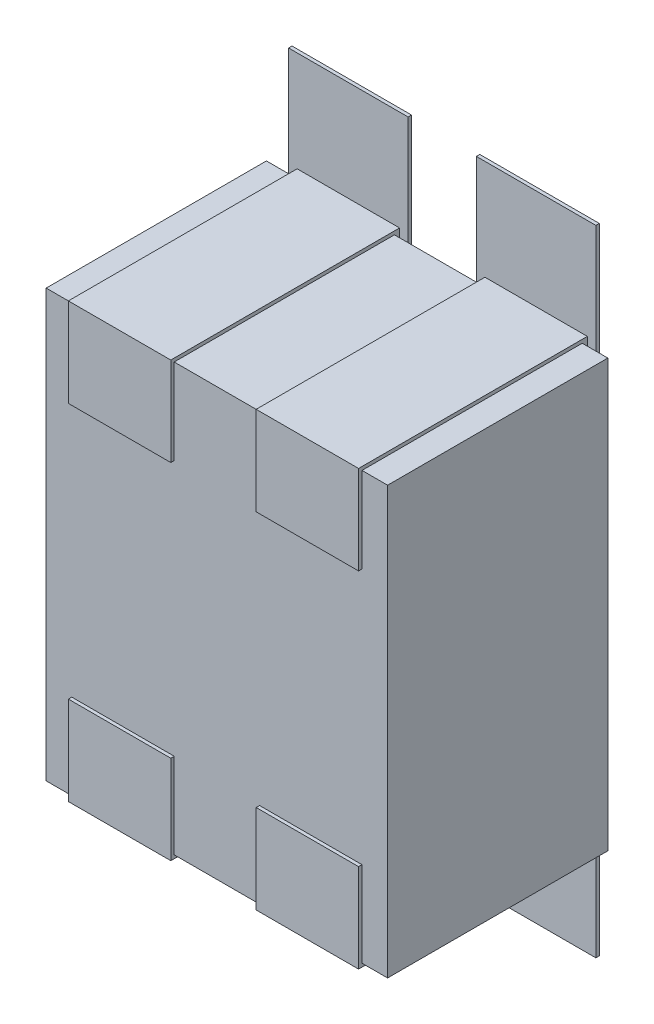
ISO-10303-21;
HEADER;
FILE_DESCRIPTION(('STEP AP214'),'2;1');
FILE_NAME('part.step','',(''),(''),'','','');
FILE_SCHEMA(('AUTOMOTIVE_DESIGN { 1 0 10303 214 1 1 1 1 }'));
ENDSEC;
DATA;
#1=APPLICATION_CONTEXT('core data for automotive mechanical design processes');
#2=APPLICATION_PROTOCOL_DEFINITION('international standard','automotive_design',2000,#1);
#3=PRODUCT_CONTEXT('',#1,'mechanical');
#4=PRODUCT('Part','Part','',(#3));
#5=PRODUCT_RELATED_PRODUCT_CATEGORY('part','',(#4));
#6=PRODUCT_DEFINITION_FORMATION('','',#4);
#7=PRODUCT_DEFINITION_CONTEXT('part definition',#1,'design');
#8=PRODUCT_DEFINITION('design','',#6,#7);
#9=PRODUCT_DEFINITION_SHAPE('','',#8);
#10=(LENGTH_UNIT() NAMED_UNIT(*) SI_UNIT(.MILLI.,.METRE.));
#11=(NAMED_UNIT(*) PLANE_ANGLE_UNIT() SI_UNIT($,.RADIAN.));
#12=(NAMED_UNIT(*) SI_UNIT($,.STERADIAN.) SOLID_ANGLE_UNIT());
#13=UNCERTAINTY_MEASURE_WITH_UNIT(LENGTH_MEASURE(1.E-05),#10,'distance_accuracy_value','');
#14=(GEOMETRIC_REPRESENTATION_CONTEXT(3) GLOBAL_UNCERTAINTY_ASSIGNED_CONTEXT((#13)) GLOBAL_UNIT_ASSIGNED_CONTEXT((#10,
#11,#12)) REPRESENTATION_CONTEXT('',''));
#15=CARTESIAN_POINT('',(0.,0.,0.));
#16=DIRECTION('',(0.,0.,1.));
#17=DIRECTION('',(1.,0.,0.));
#18=AXIS2_PLACEMENT_3D('',#15,#16,#17);
#19=CARTESIAN_POINT('',(0.,0.,0.0762));
#20=DIRECTION('',(0.,0.,1.));
#21=DIRECTION('',(1.,0.,0.));
#22=AXIS2_PLACEMENT_3D('',#19,#20,#21);
#23=PLANE('',#22);
#24=DIRECTION('',(1.,0.,0.));
#25=VECTOR('',#24,1.);
#26=CARTESIAN_POINT('',(-0.449999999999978,0.248999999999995,0.0762));
#27=LINE('',#26,#25);
#28=CARTESIAN_POINT('',(-0.449999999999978,0.248999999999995,0.0762));
#29=VERTEX_POINT('',#28);
#30=CARTESIAN_POINT('',(-0.100000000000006,0.248999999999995,0.0762));
#31=VERTEX_POINT('',#30);
#32=EDGE_CURVE('E342',#29,#31,#27,.T.);
#33=ORIENTED_EDGE('',*,*,#32,.F.);
#34=DIRECTION('',(0.,1.,0.));
#35=VECTOR('',#34,1.);
#36=CARTESIAN_POINT('',(-0.449999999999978,0.929000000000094,0.0762));
#37=LINE('',#36,#35);
#38=CARTESIAN_POINT('',(-0.449999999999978,0.929000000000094,0.0762));
#39=VERTEX_POINT('',#38);
#40=EDGE_CURVE('E19',#39,#29,#37,.F.);
#41=ORIENTED_EDGE('',*,*,#40,.F.);
#42=DIRECTION('',(1.,0.,0.));
#43=VECTOR('',#42,1.);
#44=CARTESIAN_POINT('',(-0.100000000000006,0.929000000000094,0.0762));
#45=LINE('',#44,#43);
#46=CARTESIAN_POINT('',(-0.100000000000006,0.929000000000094,0.0762));
#47=VERTEX_POINT('',#46);
#48=EDGE_CURVE('E370',#47,#39,#45,.F.);
#49=ORIENTED_EDGE('',*,*,#48,.F.);
#50=DIRECTION('',(0.,1.,0.));
#51=VECTOR('',#50,1.);
#52=CARTESIAN_POINT('',(-0.100000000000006,0.248999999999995,0.0762));
#53=LINE('',#52,#51);
#54=EDGE_CURVE('E355',#31,#47,#53,.T.);
#55=ORIENTED_EDGE('',*,*,#54,.F.);
#56=EDGE_LOOP('',(#33,#41,#49,#55));
#57=FACE_BOUND('',#56,.T.);
#58=ADVANCED_FACE('F16',(#57),#23,.F.);
#59=CARTESIAN_POINT('',(0.,0.,0.0762));
#60=DIRECTION('',(0.,0.,1.));
#61=DIRECTION('',(1.,0.,0.));
#62=AXIS2_PLACEMENT_3D('',#59,#60,#61);
#63=PLANE('',#62);
#64=DIRECTION('',(1.,0.,0.));
#65=VECTOR('',#64,1.);
#66=CARTESIAN_POINT('',(0.100000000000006,0.248999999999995,0.0762));
#67=LINE('',#66,#65);
#68=CARTESIAN_POINT('',(0.100000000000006,0.248999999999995,0.0762));
#69=VERTEX_POINT('',#68);
#70=CARTESIAN_POINT('',(0.449999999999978,0.248999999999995,0.0762));
#71=VERTEX_POINT('',#70);
#72=EDGE_CURVE('E377',#69,#71,#67,.T.);
#73=ORIENTED_EDGE('',*,*,#72,.F.);
#74=DIRECTION('',(0.,1.,0.));
#75=VECTOR('',#74,1.);
#76=CARTESIAN_POINT('',(0.100000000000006,0.929000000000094,0.0762));
#77=LINE('',#76,#75);
#78=CARTESIAN_POINT('',(0.100000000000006,0.929000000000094,0.0762));
#79=VERTEX_POINT('',#78);
#80=EDGE_CURVE('E372',#79,#69,#77,.F.);
#81=ORIENTED_EDGE('',*,*,#80,.F.);
#82=DIRECTION('',(1.,0.,0.));
#83=VECTOR('',#82,1.);
#84=CARTESIAN_POINT('',(0.449999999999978,0.929000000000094,0.0762));
#85=LINE('',#84,#83);
#86=CARTESIAN_POINT('',(0.449999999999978,0.929000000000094,0.0762));
#87=VERTEX_POINT('',#86);
#88=EDGE_CURVE('E390',#87,#79,#85,.F.);
#89=ORIENTED_EDGE('',*,*,#88,.F.);
#90=DIRECTION('',(0.,1.,0.));
#91=VECTOR('',#90,1.);
#92=CARTESIAN_POINT('',(0.449999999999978,0.248999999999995,0.0762));
#93=LINE('',#92,#91);
#94=EDGE_CURVE('E382',#71,#87,#93,.T.);
#95=ORIENTED_EDGE('',*,*,#94,.F.);
#96=EDGE_LOOP('',(#73,#81,#89,#95));
#97=FACE_BOUND('',#96,.T.);
#98=ADVANCED_FACE('F920',(#97),#63,.F.);
#99=CARTESIAN_POINT('',(0.,0.,0.0762));
#100=DIRECTION('',(0.,0.,1.));
#101=DIRECTION('',(1.,0.,0.));
#102=AXIS2_PLACEMENT_3D('',#99,#100,#101);
#103=PLANE('',#102);
#104=DIRECTION('',(1.,0.,0.));
#105=VECTOR('',#104,1.);
#106=CARTESIAN_POINT('',(0.449999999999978,-0.248999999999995,0.0762));
#107=LINE('',#106,#105);
#108=CARTESIAN_POINT('',(0.449999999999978,-0.248999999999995,0.0762));
#109=VERTEX_POINT('',#108);
#110=CARTESIAN_POINT('',(0.100000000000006,-0.248999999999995,0.0762));
#111=VERTEX_POINT('',#110);
#112=EDGE_CURVE('E398',#109,#111,#107,.F.);
#113=ORIENTED_EDGE('',*,*,#112,.F.);
#114=DIRECTION('',(0.,1.,0.));
#115=VECTOR('',#114,1.);
#116=CARTESIAN_POINT('',(0.449999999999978,-0.929000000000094,0.0762));
#117=LINE('',#116,#115);
#118=CARTESIAN_POINT('',(0.449999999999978,-0.929000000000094,0.0762));
#119=VERTEX_POINT('',#118);
#120=EDGE_CURVE('E393',#119,#109,#117,.T.);
#121=ORIENTED_EDGE('',*,*,#120,.F.);
#122=DIRECTION('',(1.,0.,0.));
#123=VECTOR('',#122,1.);
#124=CARTESIAN_POINT('',(0.100000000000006,-0.929000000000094,0.0762));
#125=LINE('',#124,#123);
#126=CARTESIAN_POINT('',(0.100000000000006,-0.929000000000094,0.0762));
#127=VERTEX_POINT('',#126);
#128=EDGE_CURVE('E411',#127,#119,#125,.T.);
#129=ORIENTED_EDGE('',*,*,#128,.F.);
#130=DIRECTION('',(0.,1.,0.));
#131=VECTOR('',#130,1.);
#132=CARTESIAN_POINT('',(0.100000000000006,-0.248999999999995,0.0762));
#133=LINE('',#132,#131);
#134=EDGE_CURVE('E403',#111,#127,#133,.F.);
#135=ORIENTED_EDGE('',*,*,#134,.F.);
#136=EDGE_LOOP('',(#113,#121,#129,#135));
#137=FACE_BOUND('',#136,.T.);
#138=ADVANCED_FACE('F912',(#137),#103,.F.);
#139=CARTESIAN_POINT('',(0.,0.,0.0762));
#140=DIRECTION('',(0.,0.,1.));
#141=DIRECTION('',(1.,0.,0.));
#142=AXIS2_PLACEMENT_3D('',#139,#140,#141);
#143=PLANE('',#142);
#144=DIRECTION('',(1.,0.,0.));
#145=VECTOR('',#144,1.);
#146=CARTESIAN_POINT('',(-0.100000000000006,-0.248999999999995,0.0762));
#147=LINE('',#146,#145);
#148=CARTESIAN_POINT('',(-0.100000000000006,-0.248999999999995,0.0762));
#149=VERTEX_POINT('',#148);
#150=CARTESIAN_POINT('',(-0.449999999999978,-0.248999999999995,0.0762));
#151=VERTEX_POINT('',#150);
#152=EDGE_CURVE('E419',#149,#151,#147,.F.);
#153=ORIENTED_EDGE('',*,*,#152,.F.);
#154=DIRECTION('',(0.,1.,0.));
#155=VECTOR('',#154,1.);
#156=CARTESIAN_POINT('',(-0.100000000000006,-0.929000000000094,0.0762));
#157=LINE('',#156,#155);
#158=CARTESIAN_POINT('',(-0.100000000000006,-0.929000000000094,0.0762));
#159=VERTEX_POINT('',#158);
#160=EDGE_CURVE('E414',#159,#149,#157,.T.);
#161=ORIENTED_EDGE('',*,*,#160,.F.);
#162=DIRECTION('',(1.,0.,0.));
#163=VECTOR('',#162,1.);
#164=CARTESIAN_POINT('',(-0.449999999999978,-0.929000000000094,0.0762));
#165=LINE('',#164,#163);
#166=CARTESIAN_POINT('',(-0.449999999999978,-0.929000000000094,0.0762));
#167=VERTEX_POINT('',#166);
#168=EDGE_CURVE('E432',#167,#159,#165,.T.);
#169=ORIENTED_EDGE('',*,*,#168,.F.);
#170=DIRECTION('',(0.,1.,0.));
#171=VECTOR('',#170,1.);
#172=CARTESIAN_POINT('',(-0.449999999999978,-0.248999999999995,0.0762));
#173=LINE('',#172,#171);
#174=EDGE_CURVE('E424',#151,#167,#173,.F.);
#175=ORIENTED_EDGE('',*,*,#174,.F.);
#176=EDGE_LOOP('',(#153,#161,#169,#175));
#177=FACE_BOUND('',#176,.T.);
#178=ADVANCED_FACE('F910',(#177),#143,.F.);
#179=CARTESIAN_POINT('',(-0.449999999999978,0.929000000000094,0.0762));
#180=DIRECTION('',(-1.,0.,0.));
#181=DIRECTION('',(0.,0.,1.));
#182=AXIS2_PLACEMENT_3D('',#179,#180,#181);
#183=PLANE('',#182);
#184=DIRECTION('',(0.,0.,1.));
#185=VECTOR('',#184,1.);
#186=CARTESIAN_POINT('',(-0.449999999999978,0.929000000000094,0.0762));
#187=LINE('',#186,#185);
#188=CARTESIAN_POINT('',(-0.449999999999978,0.929000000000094,0.0862000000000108));
#189=VERTEX_POINT('',#188);
#190=EDGE_CURVE('E351',#39,#189,#187,.T.);
#191=ORIENTED_EDGE('',*,*,#190,.F.);
#192=ORIENTED_EDGE('',*,*,#40,.T.);
#193=DIRECTION('',(0.,0.,-1.));
#194=VECTOR('',#193,1.);
#195=CARTESIAN_POINT('',(-0.449999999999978,0.248999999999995,0.0762));
#196=LINE('',#195,#194);
#197=CARTESIAN_POINT('',(-0.449999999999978,0.248999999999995,0.0862000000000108));
#198=VERTEX_POINT('',#197);
#199=EDGE_CURVE('E348',#198,#29,#196,.T.);
#200=ORIENTED_EDGE('',*,*,#199,.F.);
#201=DIRECTION('',(0.,1.,0.));
#202=VECTOR('',#201,1.);
#203=CARTESIAN_POINT('',(-0.449999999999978,0.,0.0862000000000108));
#204=LINE('',#203,#202);
#205=EDGE_CURVE('E439',#189,#198,#204,.F.);
#206=ORIENTED_EDGE('',*,*,#205,.F.);
#207=EDGE_LOOP('',(#191,#192,#200,#206));
#208=FACE_BOUND('',#207,.T.);
#209=ADVANCED_FACE('F347',(#208),#183,.T.);
#210=CARTESIAN_POINT('',(-0.449999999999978,0.248999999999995,0.0762));
#211=DIRECTION('',(0.,-1.,0.));
#212=DIRECTION('',(0.,0.,-1.));
#213=AXIS2_PLACEMENT_3D('',#210,#211,#212);
#214=PLANE('',#213);
#215=ORIENTED_EDGE('',*,*,#199,.T.);
#216=ORIENTED_EDGE('',*,*,#32,.T.);
#217=DIRECTION('',(0.,0.,-1.));
#218=VECTOR('',#217,1.);
#219=CARTESIAN_POINT('',(-0.100000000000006,0.248999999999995,0.0762));
#220=LINE('',#219,#218);
#221=CARTESIAN_POINT('',(-0.100000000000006,0.248999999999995,0.0862000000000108));
#222=VERTEX_POINT('',#221);
#223=EDGE_CURVE('E357',#222,#31,#220,.T.);
#224=ORIENTED_EDGE('',*,*,#223,.F.);
#225=DIRECTION('',(1.,0.,0.));
#226=VECTOR('',#225,1.);
#227=CARTESIAN_POINT('',(0.,0.248999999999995,0.0862000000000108));
#228=LINE('',#227,#226);
#229=EDGE_CURVE('E361',#198,#222,#228,.T.);
#230=ORIENTED_EDGE('',*,*,#229,.F.);
#231=EDGE_LOOP('',(#215,#216,#224,#230));
#232=FACE_BOUND('',#231,.T.);
#233=ADVANCED_FACE('F359',(#232),#214,.T.);
#234=CARTESIAN_POINT('',(-0.100000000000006,0.248999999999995,0.0762));
#235=DIRECTION('',(1.,0.,0.));
#236=DIRECTION('',(0.,0.,-1.));
#237=AXIS2_PLACEMENT_3D('',#234,#235,#236);
#238=PLANE('',#237);
#239=ORIENTED_EDGE('',*,*,#223,.T.);
#240=ORIENTED_EDGE('',*,*,#54,.T.);
#241=DIRECTION('',(0.,0.,1.));
#242=VECTOR('',#241,1.);
#243=CARTESIAN_POINT('',(-0.100000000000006,0.929000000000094,0.0762));
#244=LINE('',#243,#242);
#245=CARTESIAN_POINT('',(-0.100000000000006,0.929000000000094,0.0862000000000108));
#246=VERTEX_POINT('',#245);
#247=EDGE_CURVE('E367',#246,#47,#244,.F.);
#248=ORIENTED_EDGE('',*,*,#247,.F.);
#249=DIRECTION('',(0.,1.,0.));
#250=VECTOR('',#249,1.);
#251=CARTESIAN_POINT('',(-0.100000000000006,0.,0.0862000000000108));
#252=LINE('',#251,#250);
#253=EDGE_CURVE('E442',#222,#246,#252,.T.);
#254=ORIENTED_EDGE('',*,*,#253,.F.);
#255=EDGE_LOOP('',(#239,#240,#248,#254));
#256=FACE_BOUND('',#255,.T.);
#257=ADVANCED_FACE('F1055',(#256),#238,.T.);
#258=CARTESIAN_POINT('',(-0.100000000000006,0.929000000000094,0.0762));
#259=DIRECTION('',(0.,1.,0.));
#260=DIRECTION('',(0.,0.,1.));
#261=AXIS2_PLACEMENT_3D('',#258,#259,#260);
#262=PLANE('',#261);
#263=ORIENTED_EDGE('',*,*,#247,.T.);
#264=ORIENTED_EDGE('',*,*,#48,.T.);
#265=ORIENTED_EDGE('',*,*,#190,.T.);
#266=DIRECTION('',(1.,0.,0.));
#267=VECTOR('',#266,1.);
#268=CARTESIAN_POINT('',(0.,0.929000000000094,0.0862000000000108));
#269=LINE('',#268,#267);
#270=EDGE_CURVE('E445',#246,#189,#269,.F.);
#271=ORIENTED_EDGE('',*,*,#270,.F.);
#272=EDGE_LOOP('',(#263,#264,#265,#271));
#273=FACE_BOUND('',#272,.T.);
#274=ADVANCED_FACE('F1051',(#273),#262,.T.);
#275=CARTESIAN_POINT('',(0.100000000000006,0.929000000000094,0.0762));
#276=DIRECTION('',(-1.,0.,0.));
#277=DIRECTION('',(0.,0.,1.));
#278=AXIS2_PLACEMENT_3D('',#275,#276,#277);
#279=PLANE('',#278);
#280=DIRECTION('',(0.,0.,1.));
#281=VECTOR('',#280,1.);
#282=CARTESIAN_POINT('',(0.100000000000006,0.929000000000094,0.0762));
#283=LINE('',#282,#281);
#284=CARTESIAN_POINT('',(0.100000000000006,0.929000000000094,0.0862000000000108));
#285=VERTEX_POINT('',#284);
#286=EDGE_CURVE('E384',#79,#285,#283,.T.);
#287=ORIENTED_EDGE('',*,*,#286,.F.);
#288=ORIENTED_EDGE('',*,*,#80,.T.);
#289=DIRECTION('',(0.,0.,-1.));
#290=VECTOR('',#289,1.);
#291=CARTESIAN_POINT('',(0.100000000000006,0.248999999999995,0.0762));
#292=LINE('',#291,#290);
#293=CARTESIAN_POINT('',(0.100000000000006,0.248999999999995,0.0862000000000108));
#294=VERTEX_POINT('',#293);
#295=EDGE_CURVE('E374',#294,#69,#292,.T.);
#296=ORIENTED_EDGE('',*,*,#295,.F.);
#297=DIRECTION('',(0.,1.,0.));
#298=VECTOR('',#297,1.);
#299=CARTESIAN_POINT('',(0.100000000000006,0.,0.0862000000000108));
#300=LINE('',#299,#298);
#301=EDGE_CURVE('E455',#285,#294,#300,.F.);
#302=ORIENTED_EDGE('',*,*,#301,.F.);
#303=EDGE_LOOP('',(#287,#288,#296,#302));
#304=FACE_BOUND('',#303,.T.);
#305=ADVANCED_FACE('F1047',(#304),#279,.T.);
#306=CARTESIAN_POINT('',(0.100000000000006,0.248999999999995,0.0762));
#307=DIRECTION('',(0.,-1.,0.));
#308=DIRECTION('',(0.,0.,-1.));
#309=AXIS2_PLACEMENT_3D('',#306,#307,#308);
#310=PLANE('',#309);
#311=ORIENTED_EDGE('',*,*,#295,.T.);
#312=ORIENTED_EDGE('',*,*,#72,.T.);
#313=DIRECTION('',(0.,0.,-1.));
#314=VECTOR('',#313,1.);
#315=CARTESIAN_POINT('',(0.449999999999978,0.248999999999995,0.0762));
#316=LINE('',#315,#314);
#317=CARTESIAN_POINT('',(0.449999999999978,0.248999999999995,0.0862000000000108));
#318=VERTEX_POINT('',#317);
#319=EDGE_CURVE('E379',#318,#71,#316,.T.);
#320=ORIENTED_EDGE('',*,*,#319,.F.);
#321=DIRECTION('',(1.,0.,0.));
#322=VECTOR('',#321,1.);
#323=CARTESIAN_POINT('',(0.,0.248999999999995,0.0862000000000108));
#324=LINE('',#323,#322);
#325=EDGE_CURVE('E458',#294,#318,#324,.T.);
#326=ORIENTED_EDGE('',*,*,#325,.F.);
#327=EDGE_LOOP('',(#311,#312,#320,#326));
#328=FACE_BOUND('',#327,.T.);
#329=ADVANCED_FACE('F1043',(#328),#310,.T.);
#330=CARTESIAN_POINT('',(0.449999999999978,0.248999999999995,0.0762));
#331=DIRECTION('',(1.,0.,0.));
#332=DIRECTION('',(0.,0.,-1.));
#333=AXIS2_PLACEMENT_3D('',#330,#331,#332);
#334=PLANE('',#333);
#335=ORIENTED_EDGE('',*,*,#319,.T.);
#336=ORIENTED_EDGE('',*,*,#94,.T.);
#337=DIRECTION('',(0.,0.,1.));
#338=VECTOR('',#337,1.);
#339=CARTESIAN_POINT('',(0.449999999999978,0.929000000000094,0.0762));
#340=LINE('',#339,#338);
#341=CARTESIAN_POINT('',(0.449999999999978,0.929000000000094,0.0862000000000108));
#342=VERTEX_POINT('',#341);
#343=EDGE_CURVE('E387',#342,#87,#340,.F.);
#344=ORIENTED_EDGE('',*,*,#343,.F.);
#345=DIRECTION('',(0.,1.,0.));
#346=VECTOR('',#345,1.);
#347=CARTESIAN_POINT('',(0.449999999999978,0.,0.0862000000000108));
#348=LINE('',#347,#346);
#349=EDGE_CURVE('E461',#318,#342,#348,.T.);
#350=ORIENTED_EDGE('',*,*,#349,.F.);
#351=EDGE_LOOP('',(#335,#336,#344,#350));
#352=FACE_BOUND('',#351,.T.);
#353=ADVANCED_FACE('F1039',(#352),#334,.T.);
#354=CARTESIAN_POINT('',(0.449999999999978,0.929000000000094,0.0762));
#355=DIRECTION('',(0.,1.,0.));
#356=DIRECTION('',(0.,0.,1.));
#357=AXIS2_PLACEMENT_3D('',#354,#355,#356);
#358=PLANE('',#357);
#359=ORIENTED_EDGE('',*,*,#343,.T.);
#360=ORIENTED_EDGE('',*,*,#88,.T.);
#361=ORIENTED_EDGE('',*,*,#286,.T.);
#362=DIRECTION('',(1.,0.,0.));
#363=VECTOR('',#362,1.);
#364=CARTESIAN_POINT('',(0.,0.929000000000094,0.0862000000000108));
#365=LINE('',#364,#363);
#366=EDGE_CURVE('E464',#342,#285,#365,.F.);
#367=ORIENTED_EDGE('',*,*,#366,.F.);
#368=EDGE_LOOP('',(#359,#360,#361,#367));
#369=FACE_BOUND('',#368,.T.);
#370=ADVANCED_FACE('F1035',(#369),#358,.T.);
#371=CARTESIAN_POINT('',(0.449999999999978,-0.929000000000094,0.0762));
#372=DIRECTION('',(1.,0.,0.));
#373=DIRECTION('',(0.,0.,-1.));
#374=AXIS2_PLACEMENT_3D('',#371,#372,#373);
#375=PLANE('',#374);
#376=DIRECTION('',(0.,0.,-1.));
#377=VECTOR('',#376,1.);
#378=CARTESIAN_POINT('',(0.449999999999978,-0.929000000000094,0.0762));
#379=LINE('',#378,#377);
#380=CARTESIAN_POINT('',(0.449999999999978,-0.929000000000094,0.0862000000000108));
#381=VERTEX_POINT('',#380);
#382=EDGE_CURVE('E405',#119,#381,#379,.F.);
#383=ORIENTED_EDGE('',*,*,#382,.F.);
#384=ORIENTED_EDGE('',*,*,#120,.T.);
#385=DIRECTION('',(0.,0.,1.));
#386=VECTOR('',#385,1.);
#387=CARTESIAN_POINT('',(0.449999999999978,-0.248999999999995,0.0762));
#388=LINE('',#387,#386);
#389=CARTESIAN_POINT('',(0.449999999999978,-0.248999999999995,0.0862000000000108));
#390=VERTEX_POINT('',#389);
#391=EDGE_CURVE('E395',#390,#109,#388,.F.);
#392=ORIENTED_EDGE('',*,*,#391,.F.);
#393=DIRECTION('',(0.,1.,0.));
#394=VECTOR('',#393,1.);
#395=CARTESIAN_POINT('',(0.449999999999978,0.,0.0862000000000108));
#396=LINE('',#395,#394);
#397=EDGE_CURVE('E474',#381,#390,#396,.T.);
#398=ORIENTED_EDGE('',*,*,#397,.F.);
#399=EDGE_LOOP('',(#383,#384,#392,#398));
#400=FACE_BOUND('',#399,.T.);
#401=ADVANCED_FACE('F1031',(#400),#375,.T.);
#402=CARTESIAN_POINT('',(0.449999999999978,-0.248999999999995,0.0762));
#403=DIRECTION('',(0.,1.,0.));
#404=DIRECTION('',(0.,0.,1.));
#405=AXIS2_PLACEMENT_3D('',#402,#403,#404);
#406=PLANE('',#405);
#407=ORIENTED_EDGE('',*,*,#391,.T.);
#408=ORIENTED_EDGE('',*,*,#112,.T.);
#409=DIRECTION('',(0.,0.,1.));
#410=VECTOR('',#409,1.);
#411=CARTESIAN_POINT('',(0.100000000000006,-0.248999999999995,0.0762));
#412=LINE('',#411,#410);
#413=CARTESIAN_POINT('',(0.100000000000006,-0.248999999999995,0.0862000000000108));
#414=VERTEX_POINT('',#413);
#415=EDGE_CURVE('E400',#414,#111,#412,.F.);
#416=ORIENTED_EDGE('',*,*,#415,.F.);
#417=DIRECTION('',(1.,0.,0.));
#418=VECTOR('',#417,1.);
#419=CARTESIAN_POINT('',(0.,-0.248999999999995,0.0862000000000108));
#420=LINE('',#419,#418);
#421=EDGE_CURVE('E477',#390,#414,#420,.F.);
#422=ORIENTED_EDGE('',*,*,#421,.F.);
#423=EDGE_LOOP('',(#407,#408,#416,#422));
#424=FACE_BOUND('',#423,.T.);
#425=ADVANCED_FACE('F1027',(#424),#406,.T.);
#426=CARTESIAN_POINT('',(0.100000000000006,-0.248999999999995,0.0762));
#427=DIRECTION('',(-1.,0.,0.));
#428=DIRECTION('',(0.,0.,1.));
#429=AXIS2_PLACEMENT_3D('',#426,#427,#428);
#430=PLANE('',#429);
#431=ORIENTED_EDGE('',*,*,#415,.T.);
#432=ORIENTED_EDGE('',*,*,#134,.T.);
#433=DIRECTION('',(0.,0.,-1.));
#434=VECTOR('',#433,1.);
#435=CARTESIAN_POINT('',(0.100000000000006,-0.929000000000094,0.0762));
#436=LINE('',#435,#434);
#437=CARTESIAN_POINT('',(0.100000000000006,-0.929000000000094,0.0862000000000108));
#438=VERTEX_POINT('',#437);
#439=EDGE_CURVE('E408',#438,#127,#436,.T.);
#440=ORIENTED_EDGE('',*,*,#439,.F.);
#441=DIRECTION('',(0.,1.,0.));
#442=VECTOR('',#441,1.);
#443=CARTESIAN_POINT('',(0.100000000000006,0.,0.0862000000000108));
#444=LINE('',#443,#442);
#445=EDGE_CURVE('E480',#414,#438,#444,.F.);
#446=ORIENTED_EDGE('',*,*,#445,.F.);
#447=EDGE_LOOP('',(#431,#432,#440,#446));
#448=FACE_BOUND('',#447,.T.);
#449=ADVANCED_FACE('F1023',(#448),#430,.T.);
#450=CARTESIAN_POINT('',(0.100000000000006,-0.929000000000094,0.0762));
#451=DIRECTION('',(0.,-1.,0.));
#452=DIRECTION('',(0.,0.,-1.));
#453=AXIS2_PLACEMENT_3D('',#450,#451,#452);
#454=PLANE('',#453);
#455=ORIENTED_EDGE('',*,*,#439,.T.);
#456=ORIENTED_EDGE('',*,*,#128,.T.);
#457=ORIENTED_EDGE('',*,*,#382,.T.);
#458=DIRECTION('',(1.,0.,0.));
#459=VECTOR('',#458,1.);
#460=CARTESIAN_POINT('',(0.,-0.929000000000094,0.0862000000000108));
#461=LINE('',#460,#459);
#462=EDGE_CURVE('E483',#438,#381,#461,.T.);
#463=ORIENTED_EDGE('',*,*,#462,.F.);
#464=EDGE_LOOP('',(#455,#456,#457,#463));
#465=FACE_BOUND('',#464,.T.);
#466=ADVANCED_FACE('F1020',(#465),#454,.T.);
#467=CARTESIAN_POINT('',(-0.100000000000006,-0.929000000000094,0.0762));
#468=DIRECTION('',(1.,0.,0.));
#469=DIRECTION('',(0.,0.,-1.));
#470=AXIS2_PLACEMENT_3D('',#467,#468,#469);
#471=PLANE('',#470);
#472=DIRECTION('',(0.,0.,-1.));
#473=VECTOR('',#472,1.);
#474=CARTESIAN_POINT('',(-0.100000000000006,-0.929000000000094,0.0762));
#475=LINE('',#474,#473);
#476=CARTESIAN_POINT('',(-0.100000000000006,-0.929000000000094,0.0862000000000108));
#477=VERTEX_POINT('',#476);
#478=EDGE_CURVE('E426',#159,#477,#475,.F.);
#479=ORIENTED_EDGE('',*,*,#478,.F.);
#480=ORIENTED_EDGE('',*,*,#160,.T.);
#481=DIRECTION('',(0.,0.,1.));
#482=VECTOR('',#481,1.);
#483=CARTESIAN_POINT('',(-0.100000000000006,-0.248999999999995,0.0762));
#484=LINE('',#483,#482);
#485=CARTESIAN_POINT('',(-0.100000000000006,-0.248999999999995,0.0862000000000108));
#486=VERTEX_POINT('',#485);
#487=EDGE_CURVE('E416',#486,#149,#484,.F.);
#488=ORIENTED_EDGE('',*,*,#487,.F.);
#489=DIRECTION('',(0.,1.,0.));
#490=VECTOR('',#489,1.);
#491=CARTESIAN_POINT('',(-0.100000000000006,0.,0.0862000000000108));
#492=LINE('',#491,#490);
#493=EDGE_CURVE('E501',#477,#486,#492,.T.);
#494=ORIENTED_EDGE('',*,*,#493,.F.);
#495=EDGE_LOOP('',(#479,#480,#488,#494));
#496=FACE_BOUND('',#495,.T.);
#497=ADVANCED_FACE('F905',(#496),#471,.T.);
#498=CARTESIAN_POINT('',(-0.100000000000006,-0.248999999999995,0.0762));
#499=DIRECTION('',(0.,1.,0.));
#500=DIRECTION('',(0.,0.,1.));
#501=AXIS2_PLACEMENT_3D('',#498,#499,#500);
#502=PLANE('',#501);
#503=ORIENTED_EDGE('',*,*,#487,.T.);
#504=ORIENTED_EDGE('',*,*,#152,.T.);
#505=DIRECTION('',(0.,0.,1.));
#506=VECTOR('',#505,1.);
#507=CARTESIAN_POINT('',(-0.449999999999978,-0.248999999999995,0.0762));
#508=LINE('',#507,#506);
#509=CARTESIAN_POINT('',(-0.449999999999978,-0.248999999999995,0.0862000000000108));
#510=VERTEX_POINT('',#509);
#511=EDGE_CURVE('E421',#510,#151,#508,.F.);
#512=ORIENTED_EDGE('',*,*,#511,.F.);
#513=DIRECTION('',(1.,0.,0.));
#514=VECTOR('',#513,1.);
#515=CARTESIAN_POINT('',(0.,-0.248999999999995,0.0862000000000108));
#516=LINE('',#515,#514);
#517=EDGE_CURVE('E504',#486,#510,#516,.F.);
#518=ORIENTED_EDGE('',*,*,#517,.F.);
#519=EDGE_LOOP('',(#503,#504,#512,#518));
#520=FACE_BOUND('',#519,.T.);
#521=ADVANCED_FACE('F908',(#520),#502,.T.);
#522=CARTESIAN_POINT('',(-0.449999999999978,-0.248999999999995,0.0762));
#523=DIRECTION('',(-1.,0.,0.));
#524=DIRECTION('',(0.,0.,1.));
#525=AXIS2_PLACEMENT_3D('',#522,#523,#524);
#526=PLANE('',#525);
#527=ORIENTED_EDGE('',*,*,#511,.T.);
#528=ORIENTED_EDGE('',*,*,#174,.T.);
#529=DIRECTION('',(0.,0.,-1.));
#530=VECTOR('',#529,1.);
#531=CARTESIAN_POINT('',(-0.449999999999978,-0.929000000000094,0.0762));
#532=LINE('',#531,#530);
#533=CARTESIAN_POINT('',(-0.449999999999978,-0.929000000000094,0.0862000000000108));
#534=VERTEX_POINT('',#533);
#535=EDGE_CURVE('E429',#534,#167,#532,.T.);
#536=ORIENTED_EDGE('',*,*,#535,.F.);
#537=DIRECTION('',(0.,1.,0.));
#538=VECTOR('',#537,1.);
#539=CARTESIAN_POINT('',(-0.449999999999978,0.,0.0862000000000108));
#540=LINE('',#539,#538);
#541=EDGE_CURVE('E507',#510,#534,#540,.F.);
#542=ORIENTED_EDGE('',*,*,#541,.F.);
#543=EDGE_LOOP('',(#527,#528,#536,#542));
#544=FACE_BOUND('',#543,.T.);
#545=ADVANCED_FACE('F898',(#544),#526,.T.);
#546=CARTESIAN_POINT('',(-0.449999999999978,-0.929000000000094,0.0762));
#547=DIRECTION('',(0.,-1.,0.));
#548=DIRECTION('',(0.,0.,-1.));
#549=AXIS2_PLACEMENT_3D('',#546,#547,#548);
#550=PLANE('',#549);
#551=ORIENTED_EDGE('',*,*,#535,.T.);
#552=ORIENTED_EDGE('',*,*,#168,.T.);
#553=ORIENTED_EDGE('',*,*,#478,.T.);
#554=DIRECTION('',(1.,0.,0.));
#555=VECTOR('',#554,1.);
#556=CARTESIAN_POINT('',(0.,-0.929000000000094,0.0862000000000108));
#557=LINE('',#556,#555);
#558=EDGE_CURVE('E510',#534,#477,#557,.T.);
#559=ORIENTED_EDGE('',*,*,#558,.F.);
#560=EDGE_LOOP('',(#551,#552,#553,#559));
#561=FACE_BOUND('',#560,.T.);
#562=ADVANCED_FACE('F902',(#561),#550,.T.);
#563=CARTESIAN_POINT('',(-0.125000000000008,0.635,0.0762));
#564=DIRECTION('',(0.,1.,0.));
#565=DIRECTION('',(0.,0.,1.));
#566=AXIS2_PLACEMENT_3D('',#563,#564,#565);
#567=PLANE('',#566);
#568=DIRECTION('',(0.,0.,-1.));
#569=VECTOR('',#568,1.);
#570=CARTESIAN_POINT('',(-0.125000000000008,0.635,0.0762));
#571=LINE('',#570,#569);
#572=CARTESIAN_POINT('',(-0.125000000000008,0.635,0.0862000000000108));
#573=VERTEX_POINT('',#572);
#574=CARTESIAN_POINT('',(-0.125000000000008,0.635,0.75625199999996));
#575=VERTEX_POINT('',#574);
#576=EDGE_CURVE('E572',#573,#575,#571,.F.);
#577=ORIENTED_EDGE('',*,*,#576,.F.);
#578=DIRECTION('',(1.,0.,0.));
#579=VECTOR('',#578,1.);
#580=CARTESIAN_POINT('',(0.,0.635,0.0862000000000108));
#581=LINE('',#580,#579);
#582=CARTESIAN_POINT('',(-0.425000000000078,0.635,0.0862000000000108));
#583=VERTEX_POINT('',#582);
#584=EDGE_CURVE('E448',#583,#573,#581,.T.);
#585=ORIENTED_EDGE('',*,*,#584,.F.);
#586=DIRECTION('',(0.,0.,1.));
#587=VECTOR('',#586,1.);
#588=CARTESIAN_POINT('',(-0.425000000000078,0.635,0.0762));
#589=LINE('',#588,#587);
#590=CARTESIAN_POINT('',(-0.425000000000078,0.635,0.75625199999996));
#591=VERTEX_POINT('',#590);
#592=EDGE_CURVE('E562',#591,#583,#589,.F.);
#593=ORIENTED_EDGE('',*,*,#592,.F.);
#594=DIRECTION('',(1.,0.,0.));
#595=VECTOR('',#594,1.);
#596=CARTESIAN_POINT('',(-0.500000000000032,0.635,0.75625199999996));
#597=LINE('',#596,#595);
#598=EDGE_CURVE('E435',#575,#591,#597,.F.);
#599=ORIENTED_EDGE('',*,*,#598,.F.);
#600=EDGE_LOOP('',(#577,#585,#593,#599));
#601=FACE_BOUND('',#600,.T.);
#602=ADVANCED_FACE('F1007',(#601),#567,.T.);
#603=CARTESIAN_POINT('',(-0.500000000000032,-0.62500000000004,0.75625199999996));
#604=DIRECTION('',(0.,0.,1.));
#605=DIRECTION('',(1.,0.,0.));
#606=AXIS2_PLACEMENT_3D('',#603,#604,#605);
#607=PLANE('',#606);
#608=DIRECTION('',(0.,1.,0.));
#609=VECTOR('',#608,1.);
#610=CARTESIAN_POINT('',(-0.125000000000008,0.375000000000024,0.75625199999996));
#611=LINE('',#610,#609);
#612=CARTESIAN_POINT('',(-0.125000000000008,0.375000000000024,0.75625199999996));
#613=VERTEX_POINT('',#612);
#614=EDGE_CURVE('E575',#575,#613,#611,.F.);
#615=ORIENTED_EDGE('',*,*,#614,.F.);
#616=ORIENTED_EDGE('',*,*,#598,.T.);
#617=DIRECTION('',(0.,1.,0.));
#618=VECTOR('',#617,1.);
#619=CARTESIAN_POINT('',(-0.425000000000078,0.635,0.75625199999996));
#620=LINE('',#619,#618);
#621=CARTESIAN_POINT('',(-0.425000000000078,0.375000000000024,0.75625199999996));
#622=VERTEX_POINT('',#621);
#623=EDGE_CURVE('E559',#622,#591,#620,.T.);
#624=ORIENTED_EDGE('',*,*,#623,.F.);
#625=DIRECTION('',(1.,0.,0.));
#626=VECTOR('',#625,1.);
#627=CARTESIAN_POINT('',(-0.425000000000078,0.375000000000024,0.75625199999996));
#628=LINE('',#627,#626);
#629=EDGE_CURVE('E437',#613,#622,#628,.F.);
#630=ORIENTED_EDGE('',*,*,#629,.F.);
#631=EDGE_LOOP('',(#615,#616,#624,#630));
#632=FACE_BOUND('',#631,.T.);
#633=ADVANCED_FACE('F1004',(#632),#607,.T.);
#634=CARTESIAN_POINT('',(-0.425000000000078,0.375000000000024,0.0762));
#635=DIRECTION('',(0.,-1.,0.));
#636=DIRECTION('',(0.,0.,-1.));
#637=AXIS2_PLACEMENT_3D('',#634,#635,#636);
#638=PLANE('',#637);
#639=DIRECTION('',(0.,0.,1.));
#640=VECTOR('',#639,1.);
#641=CARTESIAN_POINT('',(-0.425000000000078,0.375000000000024,0.0762));
#642=LINE('',#641,#640);
#643=CARTESIAN_POINT('',(-0.425000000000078,0.375000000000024,0.746252));
#644=VERTEX_POINT('',#643);
#645=EDGE_CURVE('E556',#644,#622,#642,.T.);
#646=ORIENTED_EDGE('',*,*,#645,.F.);
#647=DIRECTION('',(1.,0.,0.));
#648=VECTOR('',#647,1.);
#649=CARTESIAN_POINT('',(-0.500000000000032,0.375000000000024,0.746252));
#650=LINE('',#649,#648);
#651=CARTESIAN_POINT('',(-0.125000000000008,0.375000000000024,0.746252));
#652=VERTEX_POINT('',#651);
#653=EDGE_CURVE('E493',#652,#644,#650,.F.);
#654=ORIENTED_EDGE('',*,*,#653,.F.);
#655=DIRECTION('',(0.,0.,-1.));
#656=VECTOR('',#655,1.);
#657=CARTESIAN_POINT('',(-0.125000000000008,0.375000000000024,0.0762));
#658=LINE('',#657,#656);
#659=EDGE_CURVE('E578',#613,#652,#658,.T.);
#660=ORIENTED_EDGE('',*,*,#659,.F.);
#661=ORIENTED_EDGE('',*,*,#629,.T.);
#662=EDGE_LOOP('',(#646,#654,#660,#661));
#663=FACE_BOUND('',#662,.T.);
#664=ADVANCED_FACE('F877',(#663),#638,.T.);
#665=CARTESIAN_POINT('',(0.,0.,0.0862000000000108));
#666=DIRECTION('',(0.,0.,1.));
#667=DIRECTION('',(1.,0.,0.));
#668=AXIS2_PLACEMENT_3D('',#665,#666,#667);
#669=PLANE('',#668);
#670=DIRECTION('',(0.,1.,0.));
#671=VECTOR('',#670,1.);
#672=CARTESIAN_POINT('',(-0.425000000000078,0.635,0.0862000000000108));
#673=LINE('',#672,#671);
#674=CARTESIAN_POINT('',(-0.425000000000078,0.375000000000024,0.0862000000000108));
#675=VERTEX_POINT('',#674);
#676=EDGE_CURVE('E565',#583,#675,#673,.F.);
#677=ORIENTED_EDGE('',*,*,#676,.F.);
#678=ORIENTED_EDGE('',*,*,#584,.T.);
#679=DIRECTION('',(0.,1.,0.));
#680=VECTOR('',#679,1.);
#681=CARTESIAN_POINT('',(-0.125000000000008,0.375000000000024,0.0862000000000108));
#682=LINE('',#681,#680);
#683=CARTESIAN_POINT('',(-0.125000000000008,0.375000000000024,0.0862000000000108));
#684=VERTEX_POINT('',#683);
#685=EDGE_CURVE('E587',#684,#573,#682,.T.);
#686=ORIENTED_EDGE('',*,*,#685,.F.);
#687=DIRECTION('',(1.,0.,0.));
#688=VECTOR('',#687,1.);
#689=CARTESIAN_POINT('',(-0.425000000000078,0.375000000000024,0.0862000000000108));
#690=LINE('',#689,#688);
#691=EDGE_CURVE('E570',#675,#684,#690,.T.);
#692=ORIENTED_EDGE('',*,*,#691,.F.);
#693=EDGE_LOOP('',(#677,#678,#686,#692));
#694=FACE_BOUND('',#693,.T.);
#695=ORIENTED_EDGE('',*,*,#253,.T.);
#696=ORIENTED_EDGE('',*,*,#270,.T.);
#697=ORIENTED_EDGE('',*,*,#205,.T.);
#698=ORIENTED_EDGE('',*,*,#229,.T.);
#699=EDGE_LOOP('',(#695,#696,#697,#698));
#700=FACE_BOUND('',#699,.T.);
#701=ADVANCED_FACE('F997',(#694,#700),#669,.T.);
#702=CARTESIAN_POINT('',(0.425000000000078,0.635,0.0762));
#703=DIRECTION('',(0.,1.,0.));
#704=DIRECTION('',(0.,0.,1.));
#705=AXIS2_PLACEMENT_3D('',#702,#703,#704);
#706=PLANE('',#705);
#707=DIRECTION('',(0.,0.,-1.));
#708=VECTOR('',#707,1.);
#709=CARTESIAN_POINT('',(0.425000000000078,0.635,0.0762));
#710=LINE('',#709,#708);
#711=CARTESIAN_POINT('',(0.425000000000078,0.635,0.0862000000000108));
#712=VERTEX_POINT('',#711);
#713=CARTESIAN_POINT('',(0.425000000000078,0.635,0.75625199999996));
#714=VERTEX_POINT('',#713);
#715=EDGE_CURVE('E617',#712,#714,#710,.F.);
#716=ORIENTED_EDGE('',*,*,#715,.F.);
#717=DIRECTION('',(1.,0.,0.));
#718=VECTOR('',#717,1.);
#719=CARTESIAN_POINT('',(0.,0.635,0.0862000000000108));
#720=LINE('',#719,#718);
#721=CARTESIAN_POINT('',(0.125000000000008,0.635,0.0862000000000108));
#722=VERTEX_POINT('',#721);
#723=EDGE_CURVE('E467',#722,#712,#720,.T.);
#724=ORIENTED_EDGE('',*,*,#723,.F.);
#725=DIRECTION('',(0.,0.,1.));
#726=VECTOR('',#725,1.);
#727=CARTESIAN_POINT('',(0.125000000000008,0.635,0.0762));
#728=LINE('',#727,#726);
#729=CARTESIAN_POINT('',(0.125000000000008,0.635,0.75625199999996));
#730=VERTEX_POINT('',#729);
#731=EDGE_CURVE('E607',#730,#722,#728,.F.);
#732=ORIENTED_EDGE('',*,*,#731,.F.);
#733=DIRECTION('',(1.,0.,0.));
#734=VECTOR('',#733,1.);
#735=CARTESIAN_POINT('',(-0.500000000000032,0.635,0.75625199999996));
#736=LINE('',#735,#734);
#737=EDGE_CURVE('E451',#714,#730,#736,.F.);
#738=ORIENTED_EDGE('',*,*,#737,.F.);
#739=EDGE_LOOP('',(#716,#724,#732,#738));
#740=FACE_BOUND('',#739,.T.);
#741=ADVANCED_FACE('F993',(#740),#706,.T.);
#742=CARTESIAN_POINT('',(-0.500000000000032,-0.62500000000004,0.75625199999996));
#743=DIRECTION('',(0.,0.,1.));
#744=DIRECTION('',(1.,0.,0.));
#745=AXIS2_PLACEMENT_3D('',#742,#743,#744);
#746=PLANE('',#745);
#747=ORIENTED_EDGE('',*,*,#737,.T.);
#748=DIRECTION('',(0.,1.,0.));
#749=VECTOR('',#748,1.);
#750=CARTESIAN_POINT('',(0.125000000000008,0.635,0.75625199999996));
#751=LINE('',#750,#749);
#752=CARTESIAN_POINT('',(0.125000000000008,0.375000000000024,0.75625199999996));
#753=VERTEX_POINT('',#752);
#754=EDGE_CURVE('E604',#753,#730,#751,.T.);
#755=ORIENTED_EDGE('',*,*,#754,.F.);
#756=DIRECTION('',(1.,0.,0.));
#757=VECTOR('',#756,1.);
#758=CARTESIAN_POINT('',(0.125000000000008,0.375000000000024,0.75625199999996));
#759=LINE('',#758,#757);
#760=CARTESIAN_POINT('',(0.425000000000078,0.375000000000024,0.75625199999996));
#761=VERTEX_POINT('',#760);
#762=EDGE_CURVE('E453',#761,#753,#759,.F.);
#763=ORIENTED_EDGE('',*,*,#762,.F.);
#764=DIRECTION('',(0.,1.,0.));
#765=VECTOR('',#764,1.);
#766=CARTESIAN_POINT('',(0.425000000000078,0.375000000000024,0.75625199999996));
#767=LINE('',#766,#765);
#768=EDGE_CURVE('E620',#714,#761,#767,.F.);
#769=ORIENTED_EDGE('',*,*,#768,.F.);
#770=EDGE_LOOP('',(#747,#755,#763,#769));
#771=FACE_BOUND('',#770,.T.);
#772=ADVANCED_FACE('F990',(#771),#746,.T.);
#773=CARTESIAN_POINT('',(0.125000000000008,0.375000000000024,0.0762));
#774=DIRECTION('',(0.,-1.,0.));
#775=DIRECTION('',(0.,0.,-1.));
#776=AXIS2_PLACEMENT_3D('',#773,#774,#775);
#777=PLANE('',#776);
#778=DIRECTION('',(0.,0.,1.));
#779=VECTOR('',#778,1.);
#780=CARTESIAN_POINT('',(0.125000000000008,0.375000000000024,0.0762));
#781=LINE('',#780,#779);
#782=CARTESIAN_POINT('',(0.125000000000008,0.375000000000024,0.746252));
#783=VERTEX_POINT('',#782);
#784=EDGE_CURVE('E601',#783,#753,#781,.T.);
#785=ORIENTED_EDGE('',*,*,#784,.F.);
#786=DIRECTION('',(1.,0.,0.));
#787=VECTOR('',#786,1.);
#788=CARTESIAN_POINT('',(-0.500000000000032,0.375000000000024,0.746252));
#789=LINE('',#788,#787);
#790=CARTESIAN_POINT('',(0.425000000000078,0.375000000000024,0.746252));
#791=VERTEX_POINT('',#790);
#792=EDGE_CURVE('E491',#791,#783,#789,.F.);
#793=ORIENTED_EDGE('',*,*,#792,.F.);
#794=DIRECTION('',(0.,0.,-1.));
#795=VECTOR('',#794,1.);
#796=CARTESIAN_POINT('',(0.425000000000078,0.375000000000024,0.0762));
#797=LINE('',#796,#795);
#798=EDGE_CURVE('E623',#761,#791,#797,.T.);
#799=ORIENTED_EDGE('',*,*,#798,.F.);
#800=ORIENTED_EDGE('',*,*,#762,.T.);
#801=EDGE_LOOP('',(#785,#793,#799,#800));
#802=FACE_BOUND('',#801,.T.);
#803=ADVANCED_FACE('F871',(#802),#777,.T.);
#804=CARTESIAN_POINT('',(0.,0.,0.0862000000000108));
#805=DIRECTION('',(0.,0.,1.));
#806=DIRECTION('',(1.,0.,0.));
#807=AXIS2_PLACEMENT_3D('',#804,#805,#806);
#808=PLANE('',#807);
#809=DIRECTION('',(1.,0.,0.));
#810=VECTOR('',#809,1.);
#811=CARTESIAN_POINT('',(0.125000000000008,0.375000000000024,0.0862000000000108));
#812=LINE('',#811,#810);
#813=CARTESIAN_POINT('',(0.125000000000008,0.375000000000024,0.0862000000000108));
#814=VERTEX_POINT('',#813);
#815=CARTESIAN_POINT('',(0.425000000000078,0.375000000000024,0.0862000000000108));
#816=VERTEX_POINT('',#815);
#817=EDGE_CURVE('E615',#814,#816,#812,.T.);
#818=ORIENTED_EDGE('',*,*,#817,.F.);
#819=DIRECTION('',(0.,1.,0.));
#820=VECTOR('',#819,1.);
#821=CARTESIAN_POINT('',(0.125000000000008,0.635,0.0862000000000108));
#822=LINE('',#821,#820);
#823=EDGE_CURVE('E610',#722,#814,#822,.F.);
#824=ORIENTED_EDGE('',*,*,#823,.F.);
#825=ORIENTED_EDGE('',*,*,#723,.T.);
#826=DIRECTION('',(0.,1.,0.));
#827=VECTOR('',#826,1.);
#828=CARTESIAN_POINT('',(0.425000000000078,0.375000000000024,0.0862000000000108));
#829=LINE('',#828,#827);
#830=EDGE_CURVE('E632',#816,#712,#829,.T.);
#831=ORIENTED_EDGE('',*,*,#830,.F.);
#832=EDGE_LOOP('',(#818,#824,#825,#831));
#833=FACE_BOUND('',#832,.T.);
#834=ORIENTED_EDGE('',*,*,#349,.T.);
#835=ORIENTED_EDGE('',*,*,#366,.T.);
#836=ORIENTED_EDGE('',*,*,#301,.T.);
#837=ORIENTED_EDGE('',*,*,#325,.T.);
#838=EDGE_LOOP('',(#834,#835,#836,#837));
#839=FACE_BOUND('',#838,.T.);
#840=ADVANCED_FACE('F984',(#833,#839),#808,.T.);
#841=CARTESIAN_POINT('',(0.125000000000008,-0.635,0.0762));
#842=DIRECTION('',(0.,-1.,0.));
#843=DIRECTION('',(0.,0.,-1.));
#844=AXIS2_PLACEMENT_3D('',#841,#842,#843);
#845=PLANE('',#844);
#846=DIRECTION('',(0.,0.,1.));
#847=VECTOR('',#846,1.);
#848=CARTESIAN_POINT('',(0.125000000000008,-0.635,0.0762));
#849=LINE('',#848,#847);
#850=CARTESIAN_POINT('',(0.125000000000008,-0.635,0.0862000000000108));
#851=VERTEX_POINT('',#850);
#852=CARTESIAN_POINT('',(0.125000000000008,-0.635,0.75625199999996));
#853=VERTEX_POINT('',#852);
#854=EDGE_CURVE('E672',#851,#853,#849,.T.);
#855=ORIENTED_EDGE('',*,*,#854,.F.);
#856=DIRECTION('',(1.,0.,0.));
#857=VECTOR('',#856,1.);
#858=CARTESIAN_POINT('',(0.,-0.635,0.0862000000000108));
#859=LINE('',#858,#857);
#860=CARTESIAN_POINT('',(0.425000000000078,-0.635,0.0862000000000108));
#861=VERTEX_POINT('',#860);
#862=EDGE_CURVE('E486',#861,#851,#859,.F.);
#863=ORIENTED_EDGE('',*,*,#862,.F.);
#864=DIRECTION('',(0.,0.,-1.));
#865=VECTOR('',#864,1.);
#866=CARTESIAN_POINT('',(0.425000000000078,-0.635,0.0762));
#867=LINE('',#866,#865);
#868=CARTESIAN_POINT('',(0.425000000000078,-0.635,0.75625199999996));
#869=VERTEX_POINT('',#868);
#870=EDGE_CURVE('E662',#869,#861,#867,.T.);
#871=ORIENTED_EDGE('',*,*,#870,.F.);
#872=DIRECTION('',(1.,0.,0.));
#873=VECTOR('',#872,1.);
#874=CARTESIAN_POINT('',(-0.500000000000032,-0.635,0.75625199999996));
#875=LINE('',#874,#873);
#876=EDGE_CURVE('E470',#853,#869,#875,.T.);
#877=ORIENTED_EDGE('',*,*,#876,.F.);
#878=EDGE_LOOP('',(#855,#863,#871,#877));
#879=FACE_BOUND('',#878,.T.);
#880=ADVANCED_FACE('F860',(#879),#845,.T.);
#881=CARTESIAN_POINT('',(-0.500000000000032,-0.62500000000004,0.75625199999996));
#882=DIRECTION('',(0.,0.,1.));
#883=DIRECTION('',(1.,0.,0.));
#884=AXIS2_PLACEMENT_3D('',#881,#882,#883);
#885=PLANE('',#884);
#886=DIRECTION('',(0.,1.,0.));
#887=VECTOR('',#886,1.);
#888=CARTESIAN_POINT('',(0.125000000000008,-0.375000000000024,0.75625199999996));
#889=LINE('',#888,#887);
#890=CARTESIAN_POINT('',(0.125000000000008,-0.375000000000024,0.75625199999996));
#891=VERTEX_POINT('',#890);
#892=EDGE_CURVE('E675',#853,#891,#889,.T.);
#893=ORIENTED_EDGE('',*,*,#892,.F.);
#894=ORIENTED_EDGE('',*,*,#876,.T.);
#895=DIRECTION('',(0.,1.,0.));
#896=VECTOR('',#895,1.);
#897=CARTESIAN_POINT('',(0.425000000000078,-0.635,0.75625199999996));
#898=LINE('',#897,#896);
#899=CARTESIAN_POINT('',(0.425000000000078,-0.375000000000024,0.75625199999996));
#900=VERTEX_POINT('',#899);
#901=EDGE_CURVE('E659',#900,#869,#898,.F.);
#902=ORIENTED_EDGE('',*,*,#901,.F.);
#903=DIRECTION('',(1.,0.,0.));
#904=VECTOR('',#903,1.);
#905=CARTESIAN_POINT('',(0.425000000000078,-0.375000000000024,0.75625199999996));
#906=LINE('',#905,#904);
#907=EDGE_CURVE('E472',#891,#900,#906,.T.);
#908=ORIENTED_EDGE('',*,*,#907,.F.);
#909=EDGE_LOOP('',(#893,#894,#902,#908));
#910=FACE_BOUND('',#909,.T.);
#911=ADVANCED_FACE('F864',(#910),#885,.T.);
#912=CARTESIAN_POINT('',(0.425000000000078,-0.375000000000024,0.0762));
#913=DIRECTION('',(0.,1.,0.));
#914=DIRECTION('',(0.,0.,1.));
#915=AXIS2_PLACEMENT_3D('',#912,#913,#914);
#916=PLANE('',#915);
#917=DIRECTION('',(0.,0.,-1.));
#918=VECTOR('',#917,1.);
#919=CARTESIAN_POINT('',(0.425000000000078,-0.375000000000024,0.0762));
#920=LINE('',#919,#918);
#921=CARTESIAN_POINT('',(0.425000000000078,-0.375000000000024,0.746252));
#922=VERTEX_POINT('',#921);
#923=EDGE_CURVE('E656',#922,#900,#920,.F.);
#924=ORIENTED_EDGE('',*,*,#923,.F.);
#925=DIRECTION('',(1.,0.,0.));
#926=VECTOR('',#925,1.);
#927=CARTESIAN_POINT('',(-0.500000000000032,-0.375000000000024,0.746252));
#928=LINE('',#927,#926);
#929=CARTESIAN_POINT('',(0.125000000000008,-0.375000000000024,0.746252));
#930=VERTEX_POINT('',#929);
#931=EDGE_CURVE('E489',#930,#922,#928,.T.);
#932=ORIENTED_EDGE('',*,*,#931,.F.);
#933=DIRECTION('',(0.,0.,1.));
#934=VECTOR('',#933,1.);
#935=CARTESIAN_POINT('',(0.125000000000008,-0.375000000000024,0.0762));
#936=LINE('',#935,#934);
#937=EDGE_CURVE('E678',#891,#930,#936,.F.);
#938=ORIENTED_EDGE('',*,*,#937,.F.);
#939=ORIENTED_EDGE('',*,*,#907,.T.);
#940=EDGE_LOOP('',(#924,#932,#938,#939));
#941=FACE_BOUND('',#940,.T.);
#942=ADVANCED_FACE('F866',(#941),#916,.T.);
#943=CARTESIAN_POINT('',(0.,0.,0.0862000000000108));
#944=DIRECTION('',(0.,0.,1.));
#945=DIRECTION('',(1.,0.,0.));
#946=AXIS2_PLACEMENT_3D('',#943,#944,#945);
#947=PLANE('',#946);
#948=DIRECTION('',(0.,1.,0.));
#949=VECTOR('',#948,1.);
#950=CARTESIAN_POINT('',(0.425000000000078,-0.635,0.0862000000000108));
#951=LINE('',#950,#949);
#952=CARTESIAN_POINT('',(0.425000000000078,-0.375000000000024,0.0862000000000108));
#953=VERTEX_POINT('',#952);
#954=EDGE_CURVE('E665',#861,#953,#951,.T.);
#955=ORIENTED_EDGE('',*,*,#954,.F.);
#956=ORIENTED_EDGE('',*,*,#862,.T.);
#957=DIRECTION('',(0.,1.,0.));
#958=VECTOR('',#957,1.);
#959=CARTESIAN_POINT('',(0.125000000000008,-0.375000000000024,0.0862000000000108));
#960=LINE('',#959,#958);
#961=CARTESIAN_POINT('',(0.125000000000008,-0.375000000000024,0.0862000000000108));
#962=VERTEX_POINT('',#961);
#963=EDGE_CURVE('E687',#962,#851,#960,.F.);
#964=ORIENTED_EDGE('',*,*,#963,.F.);
#965=DIRECTION('',(1.,0.,0.));
#966=VECTOR('',#965,1.);
#967=CARTESIAN_POINT('',(0.425000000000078,-0.375000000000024,0.0862000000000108));
#968=LINE('',#967,#966);
#969=EDGE_CURVE('E670',#953,#962,#968,.F.);
#970=ORIENTED_EDGE('',*,*,#969,.F.);
#971=EDGE_LOOP('',(#955,#956,#964,#970));
#972=FACE_BOUND('',#971,.T.);
#973=ORIENTED_EDGE('',*,*,#445,.T.);
#974=ORIENTED_EDGE('',*,*,#462,.T.);
#975=ORIENTED_EDGE('',*,*,#397,.T.);
#976=ORIENTED_EDGE('',*,*,#421,.T.);
#977=EDGE_LOOP('',(#973,#974,#975,#976));
#978=FACE_BOUND('',#977,.T.);
#979=ADVANCED_FACE('F856',(#972,#978),#947,.T.);
#980=CARTESIAN_POINT('',(-0.500000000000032,-0.62500000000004,0.746252));
#981=DIRECTION('',(0.,0.,1.));
#982=DIRECTION('',(1.,0.,0.));
#983=AXIS2_PLACEMENT_3D('',#980,#981,#982);
#984=PLANE('',#983);
#985=DIRECTION('',(1.,0.,0.));
#986=VECTOR('',#985,1.);
#987=CARTESIAN_POINT('',(-0.125000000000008,-0.375000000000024,0.746252));
#988=LINE('',#987,#986);
#989=CARTESIAN_POINT('',(-0.125000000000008,-0.375000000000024,0.746252));
#990=VERTEX_POINT('',#989);
#991=CARTESIAN_POINT('',(-0.425000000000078,-0.375000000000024,0.746252));
#992=VERTEX_POINT('',#991);
#993=EDGE_CURVE('E495',#990,#992,#988,.F.);
#994=ORIENTED_EDGE('',*,*,#993,.F.);
#995=DIRECTION('',(0.,1.,0.));
#996=VECTOR('',#995,1.);
#997=CARTESIAN_POINT('',(-0.125000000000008,-0.635,0.746252));
#998=LINE('',#997,#996);
#999=CARTESIAN_POINT('',(-0.125000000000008,-0.62500000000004,0.746252));
#1000=VERTEX_POINT('',#999);
#1001=EDGE_CURVE('E698',#1000,#990,#998,.T.);
#1002=ORIENTED_EDGE('',*,*,#1001,.F.);
#1003=DIRECTION('',(1.,0.,0.));
#1004=VECTOR('',#1003,1.);
#1005=CARTESIAN_POINT('',(0.,-0.62500000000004,0.746252));
#1006=LINE('',#1005,#1004);
#1007=CARTESIAN_POINT('',(0.125000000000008,-0.62500000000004,0.746252));
#1008=VERTEX_POINT('',#1007);
#1009=EDGE_CURVE('E690',#1000,#1008,#1006,.T.);
#1010=ORIENTED_EDGE('',*,*,#1009,.T.);
#1011=DIRECTION('',(0.,1.,0.));
#1012=VECTOR('',#1011,1.);
#1013=CARTESIAN_POINT('',(0.125000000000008,-0.375000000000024,0.746252));
#1014=LINE('',#1013,#1012);
#1015=EDGE_CURVE('E681',#930,#1008,#1014,.F.);
#1016=ORIENTED_EDGE('',*,*,#1015,.F.);
#1017=ORIENTED_EDGE('',*,*,#931,.T.);
#1018=DIRECTION('',(0.,1.,0.));
#1019=VECTOR('',#1018,1.);
#1020=CARTESIAN_POINT('',(0.425000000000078,-0.635,0.746252));
#1021=LINE('',#1020,#1019);
#1022=CARTESIAN_POINT('',(0.425000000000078,-0.62500000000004,0.746252));
#1023=VERTEX_POINT('',#1022);
#1024=EDGE_CURVE('E653',#1023,#922,#1021,.T.);
#1025=ORIENTED_EDGE('',*,*,#1024,.F.);
#1026=DIRECTION('',(1.,0.,0.));
#1027=VECTOR('',#1026,1.);
#1028=CARTESIAN_POINT('',(0.,-0.62500000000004,0.746252));
#1029=LINE('',#1028,#1027);
#1030=CARTESIAN_POINT('',(0.500000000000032,-0.62500000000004,0.746252));
#1031=VERTEX_POINT('',#1030);
#1032=EDGE_CURVE('E646',#1023,#1031,#1029,.T.);
#1033=ORIENTED_EDGE('',*,*,#1032,.T.);
#1034=DIRECTION('',(0.,1.,0.));
#1035=VECTOR('',#1034,1.);
#1036=CARTESIAN_POINT('',(0.500000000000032,-0.62500000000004,0.746252));
#1037=LINE('',#1036,#1035);
#1038=CARTESIAN_POINT('',(0.500000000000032,0.62500000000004,0.746252));
#1039=VERTEX_POINT('',#1038);
#1040=EDGE_CURVE('E643',#1039,#1031,#1037,.F.);
#1041=ORIENTED_EDGE('',*,*,#1040,.F.);
#1042=DIRECTION('',(1.,0.,0.));
#1043=VECTOR('',#1042,1.);
#1044=CARTESIAN_POINT('',(0.,0.62500000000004,0.746252));
#1045=LINE('',#1044,#1043);
#1046=CARTESIAN_POINT('',(0.425000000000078,0.62500000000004,0.746252));
#1047=VERTEX_POINT('',#1046);
#1048=EDGE_CURVE('E635',#1047,#1039,#1045,.T.);
#1049=ORIENTED_EDGE('',*,*,#1048,.F.);
#1050=DIRECTION('',(0.,1.,0.));
#1051=VECTOR('',#1050,1.);
#1052=CARTESIAN_POINT('',(0.425000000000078,0.375000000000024,0.746252));
#1053=LINE('',#1052,#1051);
#1054=EDGE_CURVE('E626',#791,#1047,#1053,.T.);
#1055=ORIENTED_EDGE('',*,*,#1054,.F.);
#1056=ORIENTED_EDGE('',*,*,#792,.T.);
#1057=DIRECTION('',(0.,1.,0.));
#1058=VECTOR('',#1057,1.);
#1059=CARTESIAN_POINT('',(0.125000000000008,0.635,0.746252));
#1060=LINE('',#1059,#1058);
#1061=CARTESIAN_POINT('',(0.125000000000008,0.62500000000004,0.746252));
#1062=VERTEX_POINT('',#1061);
#1063=EDGE_CURVE('E598',#1062,#783,#1060,.F.);
#1064=ORIENTED_EDGE('',*,*,#1063,.F.);
#1065=DIRECTION('',(1.,0.,0.));
#1066=VECTOR('',#1065,1.);
#1067=CARTESIAN_POINT('',(0.,0.62500000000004,0.746252));
#1068=LINE('',#1067,#1066);
#1069=CARTESIAN_POINT('',(-0.125000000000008,0.62500000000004,0.746252));
#1070=VERTEX_POINT('',#1069);
#1071=EDGE_CURVE('E590',#1070,#1062,#1068,.T.);
#1072=ORIENTED_EDGE('',*,*,#1071,.F.);
#1073=DIRECTION('',(0.,1.,0.));
#1074=VECTOR('',#1073,1.);
#1075=CARTESIAN_POINT('',(-0.125000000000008,0.375000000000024,0.746252));
#1076=LINE('',#1075,#1074);
#1077=EDGE_CURVE('E581',#652,#1070,#1076,.T.);
#1078=ORIENTED_EDGE('',*,*,#1077,.F.);
#1079=ORIENTED_EDGE('',*,*,#653,.T.);
#1080=DIRECTION('',(0.,1.,0.));
#1081=VECTOR('',#1080,1.);
#1082=CARTESIAN_POINT('',(-0.425000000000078,0.635,0.746252));
#1083=LINE('',#1082,#1081);
#1084=CARTESIAN_POINT('',(-0.425000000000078,0.62500000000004,0.746252));
#1085=VERTEX_POINT('',#1084);
#1086=EDGE_CURVE('E553',#1085,#644,#1083,.F.);
#1087=ORIENTED_EDGE('',*,*,#1086,.F.);
#1088=DIRECTION('',(1.,0.,0.));
#1089=VECTOR('',#1088,1.);
#1090=CARTESIAN_POINT('',(0.,0.62500000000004,0.746252));
#1091=LINE('',#1090,#1089);
#1092=CARTESIAN_POINT('',(-0.500000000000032,0.62500000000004,0.746252));
#1093=VERTEX_POINT('',#1092);
#1094=EDGE_CURVE('E548',#1093,#1085,#1091,.T.);
#1095=ORIENTED_EDGE('',*,*,#1094,.F.);
#1096=DIRECTION('',(0.,1.,0.));
#1097=VECTOR('',#1096,1.);
#1098=CARTESIAN_POINT('',(-0.500000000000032,-0.62500000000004,0.746252));
#1099=LINE('',#1098,#1097);
#1100=CARTESIAN_POINT('',(-0.500000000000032,-0.62500000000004,0.746252));
#1101=VERTEX_POINT('',#1100);
#1102=EDGE_CURVE('E540',#1101,#1093,#1099,.T.);
#1103=ORIENTED_EDGE('',*,*,#1102,.F.);
#1104=DIRECTION('',(1.,0.,0.));
#1105=VECTOR('',#1104,1.);
#1106=CARTESIAN_POINT('',(0.,-0.62500000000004,0.746252));
#1107=LINE('',#1106,#1105);
#1108=CARTESIAN_POINT('',(-0.425000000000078,-0.62500000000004,0.746252));
#1109=VERTEX_POINT('',#1108);
#1110=EDGE_CURVE('E537',#1101,#1109,#1107,.T.);
#1111=ORIENTED_EDGE('',*,*,#1110,.T.);
#1112=DIRECTION('',(0.,1.,0.));
#1113=VECTOR('',#1112,1.);
#1114=CARTESIAN_POINT('',(-0.425000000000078,-0.375000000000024,0.746252));
#1115=LINE('',#1114,#1113);
#1116=EDGE_CURVE('E527',#992,#1109,#1115,.F.);
#1117=ORIENTED_EDGE('',*,*,#1116,.F.);
#1118=EDGE_LOOP('',(#994,#1002,#1010,#1016,#1017,#1025,#1033,#1041,#1049,#1055,#1056,#1064,
#1072,#1078,#1079,#1087,#1095,#1103,#1111,#1117));
#1119=FACE_BOUND('',#1118,.T.);
#1120=ADVANCED_FACE('F779',(#1119),#984,.T.);
#1121=CARTESIAN_POINT('',(-0.125000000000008,-0.375000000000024,0.0762));
#1122=DIRECTION('',(0.,1.,0.));
#1123=DIRECTION('',(0.,0.,1.));
#1124=AXIS2_PLACEMENT_3D('',#1121,#1122,#1123);
#1125=PLANE('',#1124);
#1126=DIRECTION('',(0.,0.,-1.));
#1127=VECTOR('',#1126,1.);
#1128=CARTESIAN_POINT('',(-0.125000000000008,-0.375000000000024,0.0762));
#1129=LINE('',#1128,#1127);
#1130=CARTESIAN_POINT('',(-0.125000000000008,-0.375000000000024,0.75625199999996));
#1131=VERTEX_POINT('',#1130);
#1132=EDGE_CURVE('E701',#990,#1131,#1129,.F.);
#1133=ORIENTED_EDGE('',*,*,#1132,.F.);
#1134=ORIENTED_EDGE('',*,*,#993,.T.);
#1135=DIRECTION('',(0.,0.,1.));
#1136=VECTOR('',#1135,1.);
#1137=CARTESIAN_POINT('',(-0.425000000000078,-0.375000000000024,0.0762));
#1138=LINE('',#1137,#1136);
#1139=CARTESIAN_POINT('',(-0.425000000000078,-0.375000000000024,0.75625199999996));
#1140=VERTEX_POINT('',#1139);
#1141=EDGE_CURVE('E524',#1140,#992,#1138,.F.);
#1142=ORIENTED_EDGE('',*,*,#1141,.F.);
#1143=DIRECTION('',(1.,0.,0.));
#1144=VECTOR('',#1143,1.);
#1145=CARTESIAN_POINT('',(-0.500000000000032,-0.375000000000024,0.75625199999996));
#1146=LINE('',#1145,#1144);
#1147=EDGE_CURVE('E497',#1131,#1140,#1146,.F.);
#1148=ORIENTED_EDGE('',*,*,#1147,.F.);
#1149=EDGE_LOOP('',(#1133,#1134,#1142,#1148));
#1150=FACE_BOUND('',#1149,.T.);
#1151=ADVANCED_FACE('F882',(#1150),#1125,.T.);
#1152=CARTESIAN_POINT('',(-0.500000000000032,-0.62500000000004,0.75625199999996));
#1153=DIRECTION('',(0.,0.,1.));
#1154=DIRECTION('',(1.,0.,0.));
#1155=AXIS2_PLACEMENT_3D('',#1152,#1153,#1154);
#1156=PLANE('',#1155);
#1157=DIRECTION('',(1.,0.,0.));
#1158=VECTOR('',#1157,1.);
#1159=CARTESIAN_POINT('',(-0.425000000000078,-0.635,0.75625199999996));
#1160=LINE('',#1159,#1158);
#1161=CARTESIAN_POINT('',(-0.125000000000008,-0.635,0.75625199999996));
#1162=VERTEX_POINT('',#1161);
#1163=CARTESIAN_POINT('',(-0.425000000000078,-0.635,0.75625199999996));
#1164=VERTEX_POINT('',#1163);
#1165=EDGE_CURVE('E499',#1162,#1164,#1160,.F.);
#1166=ORIENTED_EDGE('',*,*,#1165,.F.);
#1167=DIRECTION('',(0.,1.,0.));
#1168=VECTOR('',#1167,1.);
#1169=CARTESIAN_POINT('',(-0.125000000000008,-0.635,0.75625199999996));
#1170=LINE('',#1169,#1168);
#1171=EDGE_CURVE('E704',#1131,#1162,#1170,.F.);
#1172=ORIENTED_EDGE('',*,*,#1171,.F.);
#1173=ORIENTED_EDGE('',*,*,#1147,.T.);
#1174=DIRECTION('',(0.,1.,0.));
#1175=VECTOR('',#1174,1.);
#1176=CARTESIAN_POINT('',(-0.425000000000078,-0.375000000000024,0.75625199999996));
#1177=LINE('',#1176,#1175);
#1178=EDGE_CURVE('E521',#1164,#1140,#1177,.T.);
#1179=ORIENTED_EDGE('',*,*,#1178,.F.);
#1180=EDGE_LOOP('',(#1166,#1172,#1173,#1179));
#1181=FACE_BOUND('',#1180,.T.);
#1182=ADVANCED_FACE('F886',(#1181),#1156,.T.);
#1183=CARTESIAN_POINT('',(-0.425000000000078,-0.635,0.0762));
#1184=DIRECTION('',(0.,-1.,0.));
#1185=DIRECTION('',(0.,0.,-1.));
#1186=AXIS2_PLACEMENT_3D('',#1183,#1184,#1185);
#1187=PLANE('',#1186);
#1188=DIRECTION('',(0.,0.,1.));
#1189=VECTOR('',#1188,1.);
#1190=CARTESIAN_POINT('',(-0.425000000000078,-0.635,0.0762));
#1191=LINE('',#1190,#1189);
#1192=CARTESIAN_POINT('',(-0.425000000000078,-0.635,0.0862000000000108));
#1193=VERTEX_POINT('',#1192);
#1194=EDGE_CURVE('E518',#1193,#1164,#1191,.T.);
#1195=ORIENTED_EDGE('',*,*,#1194,.F.);
#1196=DIRECTION('',(1.,0.,0.));
#1197=VECTOR('',#1196,1.);
#1198=CARTESIAN_POINT('',(0.,-0.635,0.0862000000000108));
#1199=LINE('',#1198,#1197);
#1200=CARTESIAN_POINT('',(-0.125000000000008,-0.635,0.0862000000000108));
#1201=VERTEX_POINT('',#1200);
#1202=EDGE_CURVE('E513',#1201,#1193,#1199,.F.);
#1203=ORIENTED_EDGE('',*,*,#1202,.F.);
#1204=DIRECTION('',(0.,0.,-1.));
#1205=VECTOR('',#1204,1.);
#1206=CARTESIAN_POINT('',(-0.125000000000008,-0.635,0.0762));
#1207=LINE('',#1206,#1205);
#1208=EDGE_CURVE('E707',#1162,#1201,#1207,.T.);
#1209=ORIENTED_EDGE('',*,*,#1208,.F.);
#1210=ORIENTED_EDGE('',*,*,#1165,.T.);
#1211=EDGE_LOOP('',(#1195,#1203,#1209,#1210));
#1212=FACE_BOUND('',#1211,.T.);
#1213=ADVANCED_FACE('F888',(#1212),#1187,.T.);
#1214=CARTESIAN_POINT('',(0.,0.,0.0862000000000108));
#1215=DIRECTION('',(0.,0.,1.));
#1216=DIRECTION('',(1.,0.,0.));
#1217=AXIS2_PLACEMENT_3D('',#1214,#1215,#1216);
#1218=PLANE('',#1217);
#1219=DIRECTION('',(1.,0.,0.));
#1220=VECTOR('',#1219,1.);
#1221=CARTESIAN_POINT('',(-0.125000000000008,-0.375000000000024,0.0862000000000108));
#1222=LINE('',#1221,#1220);
#1223=CARTESIAN_POINT('',(-0.125000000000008,-0.375000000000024,0.0862000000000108));
#1224=VERTEX_POINT('',#1223);
#1225=CARTESIAN_POINT('',(-0.425000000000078,-0.375000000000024,0.0862000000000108));
#1226=VERTEX_POINT('',#1225);
#1227=EDGE_CURVE('E516',#1224,#1226,#1222,.F.);
#1228=ORIENTED_EDGE('',*,*,#1227,.F.);
#1229=DIRECTION('',(0.,1.,0.));
#1230=VECTOR('',#1229,1.);
#1231=CARTESIAN_POINT('',(-0.125000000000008,-0.635,0.0862000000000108));
#1232=LINE('',#1231,#1230);
#1233=EDGE_CURVE('E710',#1201,#1224,#1232,.T.);
#1234=ORIENTED_EDGE('',*,*,#1233,.F.);
#1235=ORIENTED_EDGE('',*,*,#1202,.T.);
#1236=DIRECTION('',(0.,1.,0.));
#1237=VECTOR('',#1236,1.);
#1238=CARTESIAN_POINT('',(-0.425000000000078,-0.375000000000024,0.0862000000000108));
#1239=LINE('',#1238,#1237);
#1240=EDGE_CURVE('E532',#1226,#1193,#1239,.F.);
#1241=ORIENTED_EDGE('',*,*,#1240,.F.);
#1242=EDGE_LOOP('',(#1228,#1234,#1235,#1241));
#1243=FACE_BOUND('',#1242,.T.);
#1244=ORIENTED_EDGE('',*,*,#541,.T.);
#1245=ORIENTED_EDGE('',*,*,#558,.T.);
#1246=ORIENTED_EDGE('',*,*,#493,.T.);
#1247=ORIENTED_EDGE('',*,*,#517,.T.);
#1248=EDGE_LOOP('',(#1244,#1245,#1246,#1247));
#1249=FACE_BOUND('',#1248,.T.);
#1250=ADVANCED_FACE('F890',(#1243,#1249),#1218,.T.);
#1251=CARTESIAN_POINT('',(-0.125000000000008,-0.375000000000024,0.0762));
#1252=DIRECTION('',(0.,1.,0.));
#1253=DIRECTION('',(0.,0.,1.));
#1254=AXIS2_PLACEMENT_3D('',#1251,#1252,#1253);
#1255=PLANE('',#1254);
#1256=DIRECTION('',(0.,0.,-1.));
#1257=VECTOR('',#1256,1.);
#1258=CARTESIAN_POINT('',(-0.125000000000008,-0.375000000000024,0.0762));
#1259=LINE('',#1258,#1257);
#1260=CARTESIAN_POINT('',(-0.125000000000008,-0.375000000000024,0.101200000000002));
#1261=VERTEX_POINT('',#1260);
#1262=EDGE_CURVE('E694',#1224,#1261,#1259,.F.);
#1263=ORIENTED_EDGE('',*,*,#1262,.F.);
#1264=ORIENTED_EDGE('',*,*,#1227,.T.);
#1265=DIRECTION('',(0.,0.,1.));
#1266=VECTOR('',#1265,1.);
#1267=CARTESIAN_POINT('',(-0.425000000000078,-0.375000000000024,0.0762));
#1268=LINE('',#1267,#1266);
#1269=CARTESIAN_POINT('',(-0.425000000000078,-0.375000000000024,0.101200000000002));
#1270=VERTEX_POINT('',#1269);
#1271=EDGE_CURVE('E529',#1270,#1226,#1268,.F.);
#1272=ORIENTED_EDGE('',*,*,#1271,.F.);
#1273=DIRECTION('',(-1.,0.,0.));
#1274=VECTOR('',#1273,1.);
#1275=CARTESIAN_POINT('',(0.500000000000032,-0.375000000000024,0.101200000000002));
#1276=LINE('',#1275,#1274);
#1277=EDGE_CURVE('E713',#1261,#1270,#1276,.T.);
#1278=ORIENTED_EDGE('',*,*,#1277,.F.);
#1279=EDGE_LOOP('',(#1263,#1264,#1272,#1278));
#1280=FACE_BOUND('',#1279,.T.);
#1281=ADVANCED_FACE('F789',(#1280),#1255,.T.);
#1282=CARTESIAN_POINT('',(-0.425000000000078,-0.375000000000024,0.0762));
#1283=DIRECTION('',(-1.,0.,0.));
#1284=DIRECTION('',(0.,0.,1.));
#1285=AXIS2_PLACEMENT_3D('',#1282,#1283,#1284);
#1286=PLANE('',#1285);
#1287=ORIENTED_EDGE('',*,*,#1271,.T.);
#1288=ORIENTED_EDGE('',*,*,#1240,.T.);
#1289=ORIENTED_EDGE('',*,*,#1194,.T.);
#1290=ORIENTED_EDGE('',*,*,#1178,.T.);
#1291=ORIENTED_EDGE('',*,*,#1141,.T.);
#1292=ORIENTED_EDGE('',*,*,#1116,.T.);
#1293=DIRECTION('',(0.,0.,1.));
#1294=VECTOR('',#1293,1.);
#1295=CARTESIAN_POINT('',(-0.425000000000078,-0.62500000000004,0.0762));
#1296=LINE('',#1295,#1294);
#1297=CARTESIAN_POINT('',(-0.425000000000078,-0.62500000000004,0.101200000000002));
#1298=VERTEX_POINT('',#1297);
#1299=EDGE_CURVE('E535',#1109,#1298,#1296,.F.);
#1300=ORIENTED_EDGE('',*,*,#1299,.T.);
#1301=DIRECTION('',(0.,1.,0.));
#1302=VECTOR('',#1301,1.);
#1303=CARTESIAN_POINT('',(-0.425000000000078,-0.62500000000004,0.101200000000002));
#1304=LINE('',#1303,#1302);
#1305=EDGE_CURVE('E716',#1270,#1298,#1304,.F.);
#1306=ORIENTED_EDGE('',*,*,#1305,.F.);
#1307=EDGE_LOOP('',(#1287,#1288,#1289,#1290,#1291,#1292,#1300,#1306));
#1308=FACE_BOUND('',#1307,.T.);
#1309=ADVANCED_FACE('F794',(#1308),#1286,.T.);
#1310=CARTESIAN_POINT('',(0.,-0.62500000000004,0.0762));
#1311=DIRECTION('',(0.,1.,0.));
#1312=DIRECTION('',(0.,0.,1.));
#1313=AXIS2_PLACEMENT_3D('',#1310,#1311,#1312);
#1314=PLANE('',#1313);
#1315=DIRECTION('',(0.,0.,1.));
#1316=VECTOR('',#1315,1.);
#1317=CARTESIAN_POINT('',(-0.500000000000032,-0.62500000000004,0.101200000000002));
#1318=LINE('',#1317,#1316);
#1319=CARTESIAN_POINT('',(-0.500000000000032,-0.62500000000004,0.101200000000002));
#1320=VERTEX_POINT('',#1319);
#1321=EDGE_CURVE('E542',#1320,#1101,#1318,.T.);
#1322=ORIENTED_EDGE('',*,*,#1321,.F.);
#1323=DIRECTION('',(-1.,0.,0.));
#1324=VECTOR('',#1323,1.);
#1325=CARTESIAN_POINT('',(0.500000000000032,-0.62500000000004,0.101200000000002));
#1326=LINE('',#1325,#1324);
#1327=EDGE_CURVE('E719',#1298,#1320,#1326,.T.);
#1328=ORIENTED_EDGE('',*,*,#1327,.F.);
#1329=ORIENTED_EDGE('',*,*,#1299,.F.);
#1330=ORIENTED_EDGE('',*,*,#1110,.F.);
#1331=EDGE_LOOP('',(#1322,#1328,#1329,#1330));
#1332=FACE_BOUND('',#1331,.T.);
#1333=ADVANCED_FACE('F798',(#1332),#1314,.F.);
#1334=CARTESIAN_POINT('',(-0.500000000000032,-0.62500000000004,0.101200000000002));
#1335=DIRECTION('',(-1.,0.,0.));
#1336=DIRECTION('',(0.,0.,1.));
#1337=AXIS2_PLACEMENT_3D('',#1334,#1335,#1336);
#1338=PLANE('',#1337);
#1339=DIRECTION('',(0.,1.,0.));
#1340=VECTOR('',#1339,1.);
#1341=CARTESIAN_POINT('',(-0.500000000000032,-0.62500000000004,0.101200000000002));
#1342=LINE('',#1341,#1340);
#1343=CARTESIAN_POINT('',(-0.500000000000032,0.62500000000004,0.101200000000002));
#1344=VERTEX_POINT('',#1343);
#1345=EDGE_CURVE('E722',#1320,#1344,#1342,.T.);
#1346=ORIENTED_EDGE('',*,*,#1345,.F.);
#1347=ORIENTED_EDGE('',*,*,#1321,.T.);
#1348=ORIENTED_EDGE('',*,*,#1102,.T.);
#1349=DIRECTION('',(0.,0.,1.));
#1350=VECTOR('',#1349,1.);
#1351=CARTESIAN_POINT('',(-0.500000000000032,0.62500000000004,0.0762));
#1352=LINE('',#1351,#1350);
#1353=EDGE_CURVE('E545',#1344,#1093,#1352,.T.);
#1354=ORIENTED_EDGE('',*,*,#1353,.F.);
#1355=EDGE_LOOP('',(#1346,#1347,#1348,#1354));
#1356=FACE_BOUND('',#1355,.T.);
#1357=ADVANCED_FACE('F801',(#1356),#1338,.T.);
#1358=CARTESIAN_POINT('',(0.,0.62500000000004,0.0762));
#1359=DIRECTION('',(0.,1.,0.));
#1360=DIRECTION('',(0.,0.,1.));
#1361=AXIS2_PLACEMENT_3D('',#1358,#1359,#1360);
#1362=PLANE('',#1361);
#1363=ORIENTED_EDGE('',*,*,#1094,.T.);
#1364=DIRECTION('',(0.,0.,1.));
#1365=VECTOR('',#1364,1.);
#1366=CARTESIAN_POINT('',(-0.425000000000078,0.62500000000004,0.0762));
#1367=LINE('',#1366,#1365);
#1368=CARTESIAN_POINT('',(-0.425000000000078,0.62500000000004,0.101200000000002));
#1369=VERTEX_POINT('',#1368);
#1370=EDGE_CURVE('E550',#1369,#1085,#1367,.T.);
#1371=ORIENTED_EDGE('',*,*,#1370,.F.);
#1372=DIRECTION('',(-1.,0.,0.));
#1373=VECTOR('',#1372,1.);
#1374=CARTESIAN_POINT('',(0.500000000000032,0.62500000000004,0.101200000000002));
#1375=LINE('',#1374,#1373);
#1376=EDGE_CURVE('E725',#1344,#1369,#1375,.F.);
#1377=ORIENTED_EDGE('',*,*,#1376,.F.);
#1378=ORIENTED_EDGE('',*,*,#1353,.T.);
#1379=EDGE_LOOP('',(#1363,#1371,#1377,#1378));
#1380=FACE_BOUND('',#1379,.T.);
#1381=ADVANCED_FACE('F805',(#1380),#1362,.T.);
#1382=CARTESIAN_POINT('',(-0.425000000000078,0.635,0.0762));
#1383=DIRECTION('',(-1.,0.,0.));
#1384=DIRECTION('',(0.,0.,1.));
#1385=AXIS2_PLACEMENT_3D('',#1382,#1383,#1384);
#1386=PLANE('',#1385);
#1387=ORIENTED_EDGE('',*,*,#592,.T.);
#1388=ORIENTED_EDGE('',*,*,#676,.T.);
#1389=DIRECTION('',(0.,0.,-1.));
#1390=VECTOR('',#1389,1.);
#1391=CARTESIAN_POINT('',(-0.425000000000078,0.375000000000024,0.0762));
#1392=LINE('',#1391,#1390);
#1393=CARTESIAN_POINT('',(-0.425000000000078,0.375000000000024,0.101200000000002));
#1394=VERTEX_POINT('',#1393);
#1395=EDGE_CURVE('E567',#1394,#675,#1392,.T.);
#1396=ORIENTED_EDGE('',*,*,#1395,.F.);
#1397=DIRECTION('',(0.,1.,0.));
#1398=VECTOR('',#1397,1.);
#1399=CARTESIAN_POINT('',(-0.425000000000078,-0.62500000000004,0.101200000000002));
#1400=LINE('',#1399,#1398);
#1401=EDGE_CURVE('E728',#1369,#1394,#1400,.F.);
#1402=ORIENTED_EDGE('',*,*,#1401,.F.);
#1403=ORIENTED_EDGE('',*,*,#1370,.T.);
#1404=ORIENTED_EDGE('',*,*,#1086,.T.);
#1405=ORIENTED_EDGE('',*,*,#645,.T.);
#1406=ORIENTED_EDGE('',*,*,#623,.T.);
#1407=EDGE_LOOP('',(#1387,#1388,#1396,#1402,#1403,#1404,#1405,#1406));
#1408=FACE_BOUND('',#1407,.T.);
#1409=ADVANCED_FACE('F809',(#1408),#1386,.T.);
#1410=CARTESIAN_POINT('',(-0.425000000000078,0.375000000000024,0.0762));
#1411=DIRECTION('',(0.,-1.,0.));
#1412=DIRECTION('',(0.,0.,-1.));
#1413=AXIS2_PLACEMENT_3D('',#1410,#1411,#1412);
#1414=PLANE('',#1413);
#1415=ORIENTED_EDGE('',*,*,#1395,.T.);
#1416=ORIENTED_EDGE('',*,*,#691,.T.);
#1417=DIRECTION('',(0.,0.,-1.));
#1418=VECTOR('',#1417,1.);
#1419=CARTESIAN_POINT('',(-0.125000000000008,0.375000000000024,0.0762));
#1420=LINE('',#1419,#1418);
#1421=CARTESIAN_POINT('',(-0.125000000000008,0.375000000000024,0.101200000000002));
#1422=VERTEX_POINT('',#1421);
#1423=EDGE_CURVE('E584',#1422,#684,#1420,.T.);
#1424=ORIENTED_EDGE('',*,*,#1423,.F.);
#1425=DIRECTION('',(-1.,0.,0.));
#1426=VECTOR('',#1425,1.);
#1427=CARTESIAN_POINT('',(0.500000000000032,0.375000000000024,0.101200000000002));
#1428=LINE('',#1427,#1426);
#1429=EDGE_CURVE('E731',#1394,#1422,#1428,.F.);
#1430=ORIENTED_EDGE('',*,*,#1429,.F.);
#1431=EDGE_LOOP('',(#1415,#1416,#1424,#1430));
#1432=FACE_BOUND('',#1431,.T.);
#1433=ADVANCED_FACE('F814',(#1432),#1414,.T.);
#1434=CARTESIAN_POINT('',(-0.125000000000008,0.375000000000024,0.0762));
#1435=DIRECTION('',(1.,0.,0.));
#1436=DIRECTION('',(0.,0.,-1.));
#1437=AXIS2_PLACEMENT_3D('',#1434,#1435,#1436);
#1438=PLANE('',#1437);
#1439=ORIENTED_EDGE('',*,*,#1423,.T.);
#1440=ORIENTED_EDGE('',*,*,#685,.T.);
#1441=ORIENTED_EDGE('',*,*,#576,.T.);
#1442=ORIENTED_EDGE('',*,*,#614,.T.);
#1443=ORIENTED_EDGE('',*,*,#659,.T.);
#1444=ORIENTED_EDGE('',*,*,#1077,.T.);
#1445=DIRECTION('',(0.,0.,1.));
#1446=VECTOR('',#1445,1.);
#1447=CARTESIAN_POINT('',(-0.125000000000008,0.62500000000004,0.0762));
#1448=LINE('',#1447,#1446);
#1449=CARTESIAN_POINT('',(-0.125000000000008,0.62500000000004,0.101200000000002));
#1450=VERTEX_POINT('',#1449);
#1451=EDGE_CURVE('E592',#1450,#1070,#1448,.T.);
#1452=ORIENTED_EDGE('',*,*,#1451,.F.);
#1453=DIRECTION('',(0.,1.,0.));
#1454=VECTOR('',#1453,1.);
#1455=CARTESIAN_POINT('',(-0.125000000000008,-0.62500000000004,0.101200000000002));
#1456=LINE('',#1455,#1454);
#1457=EDGE_CURVE('E734',#1422,#1450,#1456,.T.);
#1458=ORIENTED_EDGE('',*,*,#1457,.F.);
#1459=EDGE_LOOP('',(#1439,#1440,#1441,#1442,#1443,#1444,#1452,#1458));
#1460=FACE_BOUND('',#1459,.T.);
#1461=ADVANCED_FACE('F818',(#1460),#1438,.T.);
#1462=CARTESIAN_POINT('',(0.,0.62500000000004,0.0762));
#1463=DIRECTION('',(0.,1.,0.));
#1464=DIRECTION('',(0.,0.,1.));
#1465=AXIS2_PLACEMENT_3D('',#1462,#1463,#1464);
#1466=PLANE('',#1465);
#1467=DIRECTION('',(-1.,0.,0.));
#1468=VECTOR('',#1467,1.);
#1469=CARTESIAN_POINT('',(0.500000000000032,0.62500000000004,0.101200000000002));
#1470=LINE('',#1469,#1468);
#1471=CARTESIAN_POINT('',(0.125000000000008,0.62500000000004,0.101200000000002));
#1472=VERTEX_POINT('',#1471);
#1473=EDGE_CURVE('E737',#1450,#1472,#1470,.F.);
#1474=ORIENTED_EDGE('',*,*,#1473,.F.);
#1475=ORIENTED_EDGE('',*,*,#1451,.T.);
#1476=ORIENTED_EDGE('',*,*,#1071,.T.);
#1477=DIRECTION('',(0.,0.,1.));
#1478=VECTOR('',#1477,1.);
#1479=CARTESIAN_POINT('',(0.125000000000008,0.62500000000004,0.0762));
#1480=LINE('',#1479,#1478);
#1481=EDGE_CURVE('E595',#1472,#1062,#1480,.T.);
#1482=ORIENTED_EDGE('',*,*,#1481,.F.);
#1483=EDGE_LOOP('',(#1474,#1475,#1476,#1482));
#1484=FACE_BOUND('',#1483,.T.);
#1485=ADVANCED_FACE('F821',(#1484),#1466,.T.);
#1486=CARTESIAN_POINT('',(0.125000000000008,0.635,0.0762));
#1487=DIRECTION('',(-1.,0.,0.));
#1488=DIRECTION('',(0.,0.,1.));
#1489=AXIS2_PLACEMENT_3D('',#1486,#1487,#1488);
#1490=PLANE('',#1489);
#1491=ORIENTED_EDGE('',*,*,#731,.T.);
#1492=ORIENTED_EDGE('',*,*,#823,.T.);
#1493=DIRECTION('',(0.,0.,-1.));
#1494=VECTOR('',#1493,1.);
#1495=CARTESIAN_POINT('',(0.125000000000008,0.375000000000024,0.0762));
#1496=LINE('',#1495,#1494);
#1497=CARTESIAN_POINT('',(0.125000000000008,0.375000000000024,0.101200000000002));
#1498=VERTEX_POINT('',#1497);
#1499=EDGE_CURVE('E612',#1498,#814,#1496,.T.);
#1500=ORIENTED_EDGE('',*,*,#1499,.F.);
#1501=DIRECTION('',(0.,1.,0.));
#1502=VECTOR('',#1501,1.);
#1503=CARTESIAN_POINT('',(0.125000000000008,-0.62500000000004,0.101200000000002));
#1504=LINE('',#1503,#1502);
#1505=EDGE_CURVE('E740',#1472,#1498,#1504,.F.);
#1506=ORIENTED_EDGE('',*,*,#1505,.F.);
#1507=ORIENTED_EDGE('',*,*,#1481,.T.);
#1508=ORIENTED_EDGE('',*,*,#1063,.T.);
#1509=ORIENTED_EDGE('',*,*,#784,.T.);
#1510=ORIENTED_EDGE('',*,*,#754,.T.);
#1511=EDGE_LOOP('',(#1491,#1492,#1500,#1506,#1507,#1508,#1509,#1510));
#1512=FACE_BOUND('',#1511,.T.);
#1513=ADVANCED_FACE('F825',(#1512),#1490,.T.);
#1514=CARTESIAN_POINT('',(0.125000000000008,0.375000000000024,0.0762));
#1515=DIRECTION('',(0.,-1.,0.));
#1516=DIRECTION('',(0.,0.,-1.));
#1517=AXIS2_PLACEMENT_3D('',#1514,#1515,#1516);
#1518=PLANE('',#1517);
#1519=ORIENTED_EDGE('',*,*,#1499,.T.);
#1520=ORIENTED_EDGE('',*,*,#817,.T.);
#1521=DIRECTION('',(0.,0.,-1.));
#1522=VECTOR('',#1521,1.);
#1523=CARTESIAN_POINT('',(0.425000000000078,0.375000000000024,0.0762));
#1524=LINE('',#1523,#1522);
#1525=CARTESIAN_POINT('',(0.425000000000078,0.375000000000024,0.101200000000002));
#1526=VERTEX_POINT('',#1525);
#1527=EDGE_CURVE('E629',#1526,#816,#1524,.T.);
#1528=ORIENTED_EDGE('',*,*,#1527,.F.);
#1529=DIRECTION('',(-1.,0.,0.));
#1530=VECTOR('',#1529,1.);
#1531=CARTESIAN_POINT('',(0.500000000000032,0.375000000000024,0.101200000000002));
#1532=LINE('',#1531,#1530);
#1533=EDGE_CURVE('E743',#1498,#1526,#1532,.F.);
#1534=ORIENTED_EDGE('',*,*,#1533,.F.);
#1535=EDGE_LOOP('',(#1519,#1520,#1528,#1534));
#1536=FACE_BOUND('',#1535,.T.);
#1537=ADVANCED_FACE('F829',(#1536),#1518,.T.);
#1538=CARTESIAN_POINT('',(0.425000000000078,0.375000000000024,0.0762));
#1539=DIRECTION('',(1.,0.,0.));
#1540=DIRECTION('',(0.,0.,-1.));
#1541=AXIS2_PLACEMENT_3D('',#1538,#1539,#1540);
#1542=PLANE('',#1541);
#1543=ORIENTED_EDGE('',*,*,#1527,.T.);
#1544=ORIENTED_EDGE('',*,*,#830,.T.);
#1545=ORIENTED_EDGE('',*,*,#715,.T.);
#1546=ORIENTED_EDGE('',*,*,#768,.T.);
#1547=ORIENTED_EDGE('',*,*,#798,.T.);
#1548=ORIENTED_EDGE('',*,*,#1054,.T.);
#1549=DIRECTION('',(0.,0.,1.));
#1550=VECTOR('',#1549,1.);
#1551=CARTESIAN_POINT('',(0.425000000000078,0.62500000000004,0.0762));
#1552=LINE('',#1551,#1550);
#1553=CARTESIAN_POINT('',(0.425000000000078,0.62500000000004,0.101200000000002));
#1554=VERTEX_POINT('',#1553);
#1555=EDGE_CURVE('E637',#1554,#1047,#1552,.T.);
#1556=ORIENTED_EDGE('',*,*,#1555,.F.);
#1557=DIRECTION('',(0.,1.,0.));
#1558=VECTOR('',#1557,1.);
#1559=CARTESIAN_POINT('',(0.425000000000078,-0.62500000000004,0.101200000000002));
#1560=LINE('',#1559,#1558);
#1561=EDGE_CURVE('E746',#1526,#1554,#1560,.T.);
#1562=ORIENTED_EDGE('',*,*,#1561,.F.);
#1563=EDGE_LOOP('',(#1543,#1544,#1545,#1546,#1547,#1548,#1556,#1562));
#1564=FACE_BOUND('',#1563,.T.);
#1565=ADVANCED_FACE('F833',(#1564),#1542,.T.);
#1566=CARTESIAN_POINT('',(0.,0.62500000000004,0.0762));
#1567=DIRECTION('',(0.,1.,0.));
#1568=DIRECTION('',(0.,0.,1.));
#1569=AXIS2_PLACEMENT_3D('',#1566,#1567,#1568);
#1570=PLANE('',#1569);
#1571=DIRECTION('',(-1.,0.,0.));
#1572=VECTOR('',#1571,1.);
#1573=CARTESIAN_POINT('',(0.500000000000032,0.62500000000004,0.101200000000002));
#1574=LINE('',#1573,#1572);
#1575=CARTESIAN_POINT('',(0.500000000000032,0.62500000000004,0.101200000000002));
#1576=VERTEX_POINT('',#1575);
#1577=EDGE_CURVE('E749',#1554,#1576,#1574,.F.);
#1578=ORIENTED_EDGE('',*,*,#1577,.F.);
#1579=ORIENTED_EDGE('',*,*,#1555,.T.);
#1580=ORIENTED_EDGE('',*,*,#1048,.T.);
#1581=DIRECTION('',(0.,0.,-1.));
#1582=VECTOR('',#1581,1.);
#1583=CARTESIAN_POINT('',(0.500000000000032,0.62500000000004,0.746252));
#1584=LINE('',#1583,#1582);
#1585=EDGE_CURVE('E640',#1576,#1039,#1584,.F.);
#1586=ORIENTED_EDGE('',*,*,#1585,.F.);
#1587=EDGE_LOOP('',(#1578,#1579,#1580,#1586));
#1588=FACE_BOUND('',#1587,.T.);
#1589=ADVANCED_FACE('F837',(#1588),#1570,.T.);
#1590=CARTESIAN_POINT('',(0.500000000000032,-0.62500000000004,0.746252));
#1591=DIRECTION('',(1.,0.,0.));
#1592=DIRECTION('',(0.,0.,-1.));
#1593=AXIS2_PLACEMENT_3D('',#1590,#1591,#1592);
#1594=PLANE('',#1593);
#1595=ORIENTED_EDGE('',*,*,#1040,.T.);
#1596=DIRECTION('',(0.,0.,1.));
#1597=VECTOR('',#1596,1.);
#1598=CARTESIAN_POINT('',(0.500000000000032,-0.62500000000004,0.0762));
#1599=LINE('',#1598,#1597);
#1600=CARTESIAN_POINT('',(0.500000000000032,-0.62500000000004,0.101200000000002));
#1601=VERTEX_POINT('',#1600);
#1602=EDGE_CURVE('E648',#1031,#1601,#1599,.F.);
#1603=ORIENTED_EDGE('',*,*,#1602,.T.);
#1604=DIRECTION('',(0.,1.,0.));
#1605=VECTOR('',#1604,1.);
#1606=CARTESIAN_POINT('',(0.500000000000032,-0.62500000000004,0.101200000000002));
#1607=LINE('',#1606,#1605);
#1608=EDGE_CURVE('E752',#1576,#1601,#1607,.F.);
#1609=ORIENTED_EDGE('',*,*,#1608,.F.);
#1610=ORIENTED_EDGE('',*,*,#1585,.T.);
#1611=EDGE_LOOP('',(#1595,#1603,#1609,#1610));
#1612=FACE_BOUND('',#1611,.T.);
#1613=ADVANCED_FACE('F841',(#1612),#1594,.T.);
#1614=CARTESIAN_POINT('',(0.,-0.62500000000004,0.0762));
#1615=DIRECTION('',(0.,1.,0.));
#1616=DIRECTION('',(0.,0.,1.));
#1617=AXIS2_PLACEMENT_3D('',#1614,#1615,#1616);
#1618=PLANE('',#1617);
#1619=ORIENTED_EDGE('',*,*,#1602,.F.);
#1620=ORIENTED_EDGE('',*,*,#1032,.F.);
#1621=DIRECTION('',(0.,0.,-1.));
#1622=VECTOR('',#1621,1.);
#1623=CARTESIAN_POINT('',(0.425000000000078,-0.62500000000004,0.0762));
#1624=LINE('',#1623,#1622);
#1625=CARTESIAN_POINT('',(0.425000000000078,-0.62500000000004,0.101200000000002));
#1626=VERTEX_POINT('',#1625);
#1627=EDGE_CURVE('E650',#1626,#1023,#1624,.F.);
#1628=ORIENTED_EDGE('',*,*,#1627,.F.);
#1629=DIRECTION('',(-1.,0.,0.));
#1630=VECTOR('',#1629,1.);
#1631=CARTESIAN_POINT('',(0.500000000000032,-0.62500000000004,0.101200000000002));
#1632=LINE('',#1631,#1630);
#1633=EDGE_CURVE('E755',#1601,#1626,#1632,.T.);
#1634=ORIENTED_EDGE('',*,*,#1633,.F.);
#1635=EDGE_LOOP('',(#1619,#1620,#1628,#1634));
#1636=FACE_BOUND('',#1635,.T.);
#1637=ADVANCED_FACE('F845',(#1636),#1618,.F.);
#1638=CARTESIAN_POINT('',(0.425000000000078,-0.635,0.0762));
#1639=DIRECTION('',(1.,0.,0.));
#1640=DIRECTION('',(0.,0.,-1.));
#1641=AXIS2_PLACEMENT_3D('',#1638,#1639,#1640);
#1642=PLANE('',#1641);
#1643=ORIENTED_EDGE('',*,*,#870,.T.);
#1644=ORIENTED_EDGE('',*,*,#954,.T.);
#1645=DIRECTION('',(0.,0.,1.));
#1646=VECTOR('',#1645,1.);
#1647=CARTESIAN_POINT('',(0.425000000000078,-0.375000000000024,0.0762));
#1648=LINE('',#1647,#1646);
#1649=CARTESIAN_POINT('',(0.425000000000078,-0.375000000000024,0.101200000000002));
#1650=VERTEX_POINT('',#1649);
#1651=EDGE_CURVE('E667',#1650,#953,#1648,.F.);
#1652=ORIENTED_EDGE('',*,*,#1651,.F.);
#1653=DIRECTION('',(0.,1.,0.));
#1654=VECTOR('',#1653,1.);
#1655=CARTESIAN_POINT('',(0.425000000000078,-0.62500000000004,0.101200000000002));
#1656=LINE('',#1655,#1654);
#1657=EDGE_CURVE('E758',#1626,#1650,#1656,.T.);
#1658=ORIENTED_EDGE('',*,*,#1657,.F.);
#1659=ORIENTED_EDGE('',*,*,#1627,.T.);
#1660=ORIENTED_EDGE('',*,*,#1024,.T.);
#1661=ORIENTED_EDGE('',*,*,#923,.T.);
#1662=ORIENTED_EDGE('',*,*,#901,.T.);
#1663=EDGE_LOOP('',(#1643,#1644,#1652,#1658,#1659,#1660,#1661,#1662));
#1664=FACE_BOUND('',#1663,.T.);
#1665=ADVANCED_FACE('F848',(#1664),#1642,.T.);
#1666=CARTESIAN_POINT('',(0.425000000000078,-0.375000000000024,0.0762));
#1667=DIRECTION('',(0.,1.,0.));
#1668=DIRECTION('',(0.,0.,1.));
#1669=AXIS2_PLACEMENT_3D('',#1666,#1667,#1668);
#1670=PLANE('',#1669);
#1671=ORIENTED_EDGE('',*,*,#1651,.T.);
#1672=ORIENTED_EDGE('',*,*,#969,.T.);
#1673=DIRECTION('',(0.,0.,1.));
#1674=VECTOR('',#1673,1.);
#1675=CARTESIAN_POINT('',(0.125000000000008,-0.375000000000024,0.0762));
#1676=LINE('',#1675,#1674);
#1677=CARTESIAN_POINT('',(0.125000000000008,-0.375000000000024,0.101200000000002));
#1678=VERTEX_POINT('',#1677);
#1679=EDGE_CURVE('E684',#1678,#962,#1676,.F.);
#1680=ORIENTED_EDGE('',*,*,#1679,.F.);
#1681=DIRECTION('',(-1.,0.,0.));
#1682=VECTOR('',#1681,1.);
#1683=CARTESIAN_POINT('',(0.500000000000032,-0.375000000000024,0.101200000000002));
#1684=LINE('',#1683,#1682);
#1685=EDGE_CURVE('E761',#1650,#1678,#1684,.T.);
#1686=ORIENTED_EDGE('',*,*,#1685,.F.);
#1687=EDGE_LOOP('',(#1671,#1672,#1680,#1686));
#1688=FACE_BOUND('',#1687,.T.);
#1689=ADVANCED_FACE('F851',(#1688),#1670,.T.);
#1690=CARTESIAN_POINT('',(0.125000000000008,-0.375000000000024,0.0762));
#1691=DIRECTION('',(-1.,0.,0.));
#1692=DIRECTION('',(0.,0.,1.));
#1693=AXIS2_PLACEMENT_3D('',#1690,#1691,#1692);
#1694=PLANE('',#1693);
#1695=ORIENTED_EDGE('',*,*,#1679,.T.);
#1696=ORIENTED_EDGE('',*,*,#963,.T.);
#1697=ORIENTED_EDGE('',*,*,#854,.T.);
#1698=ORIENTED_EDGE('',*,*,#892,.T.);
#1699=ORIENTED_EDGE('',*,*,#937,.T.);
#1700=ORIENTED_EDGE('',*,*,#1015,.T.);
#1701=DIRECTION('',(0.,0.,1.));
#1702=VECTOR('',#1701,1.);
#1703=CARTESIAN_POINT('',(0.125000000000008,-0.62500000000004,0.0762));
#1704=LINE('',#1703,#1702);
#1705=CARTESIAN_POINT('',(0.125000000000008,-0.62500000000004,0.101200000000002));
#1706=VERTEX_POINT('',#1705);
#1707=EDGE_CURVE('E692',#1008,#1706,#1704,.F.);
#1708=ORIENTED_EDGE('',*,*,#1707,.T.);
#1709=DIRECTION('',(0.,1.,0.));
#1710=VECTOR('',#1709,1.);
#1711=CARTESIAN_POINT('',(0.125000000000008,-0.62500000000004,0.101200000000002));
#1712=LINE('',#1711,#1710);
#1713=EDGE_CURVE('E764',#1678,#1706,#1712,.F.);
#1714=ORIENTED_EDGE('',*,*,#1713,.F.);
#1715=EDGE_LOOP('',(#1695,#1696,#1697,#1698,#1699,#1700,#1708,#1714));
#1716=FACE_BOUND('',#1715,.T.);
#1717=ADVANCED_FACE('F775',(#1716),#1694,.T.);
#1718=CARTESIAN_POINT('',(0.,-0.62500000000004,0.0762));
#1719=DIRECTION('',(0.,1.,0.));
#1720=DIRECTION('',(0.,0.,1.));
#1721=AXIS2_PLACEMENT_3D('',#1718,#1719,#1720);
#1722=PLANE('',#1721);
#1723=ORIENTED_EDGE('',*,*,#1707,.F.);
#1724=ORIENTED_EDGE('',*,*,#1009,.F.);
#1725=DIRECTION('',(0.,0.,-1.));
#1726=VECTOR('',#1725,1.);
#1727=CARTESIAN_POINT('',(-0.125000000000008,-0.62500000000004,0.0762));
#1728=LINE('',#1727,#1726);
#1729=CARTESIAN_POINT('',(-0.125000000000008,-0.62500000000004,0.101200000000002));
#1730=VERTEX_POINT('',#1729);
#1731=EDGE_CURVE('E34',#1730,#1000,#1728,.F.);
#1732=ORIENTED_EDGE('',*,*,#1731,.F.);
#1733=DIRECTION('',(-1.,0.,0.));
#1734=VECTOR('',#1733,1.);
#1735=CARTESIAN_POINT('',(0.500000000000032,-0.62500000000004,0.101200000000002));
#1736=LINE('',#1735,#1734);
#1737=EDGE_CURVE('E25',#1706,#1730,#1736,.T.);
#1738=ORIENTED_EDGE('',*,*,#1737,.F.);
#1739=EDGE_LOOP('',(#1723,#1724,#1732,#1738));
#1740=FACE_BOUND('',#1739,.T.);
#1741=ADVANCED_FACE('F772',(#1740),#1722,.F.);
#1742=CARTESIAN_POINT('',(-0.125000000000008,-0.635,0.0762));
#1743=DIRECTION('',(1.,0.,0.));
#1744=DIRECTION('',(0.,0.,-1.));
#1745=AXIS2_PLACEMENT_3D('',#1742,#1743,#1744);
#1746=PLANE('',#1745);
#1747=ORIENTED_EDGE('',*,*,#1208,.T.);
#1748=ORIENTED_EDGE('',*,*,#1233,.T.);
#1749=ORIENTED_EDGE('',*,*,#1262,.T.);
#1750=DIRECTION('',(0.,1.,0.));
#1751=VECTOR('',#1750,1.);
#1752=CARTESIAN_POINT('',(-0.125000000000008,-0.62500000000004,0.101200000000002));
#1753=LINE('',#1752,#1751);
#1754=EDGE_CURVE('E11',#1730,#1261,#1753,.T.);
#1755=ORIENTED_EDGE('',*,*,#1754,.F.);
#1756=ORIENTED_EDGE('',*,*,#1731,.T.);
#1757=ORIENTED_EDGE('',*,*,#1001,.T.);
#1758=ORIENTED_EDGE('',*,*,#1132,.T.);
#1759=ORIENTED_EDGE('',*,*,#1171,.T.);
#1760=EDGE_LOOP('',(#1747,#1748,#1749,#1755,#1756,#1757,#1758,#1759));
#1761=FACE_BOUND('',#1760,.T.);
#1762=ADVANCED_FACE('F785',(#1761),#1746,.T.);
#1763=CARTESIAN_POINT('',(0.500000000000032,-0.62500000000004,0.101200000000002));
#1764=DIRECTION('',(0.,0.,-1.));
#1765=DIRECTION('',(-1.,0.,0.));
#1766=AXIS2_PLACEMENT_3D('',#1763,#1764,#1765);
#1767=PLANE('',#1766);
#1768=ORIENTED_EDGE('',*,*,#1737,.T.);
#1769=ORIENTED_EDGE('',*,*,#1754,.T.);
#1770=ORIENTED_EDGE('',*,*,#1277,.T.);
#1771=ORIENTED_EDGE('',*,*,#1305,.T.);
#1772=ORIENTED_EDGE('',*,*,#1327,.T.);
#1773=ORIENTED_EDGE('',*,*,#1345,.T.);
#1774=ORIENTED_EDGE('',*,*,#1376,.T.);
#1775=ORIENTED_EDGE('',*,*,#1401,.T.);
#1776=ORIENTED_EDGE('',*,*,#1429,.T.);
#1777=ORIENTED_EDGE('',*,*,#1457,.T.);
#1778=ORIENTED_EDGE('',*,*,#1473,.T.);
#1779=ORIENTED_EDGE('',*,*,#1505,.T.);
#1780=ORIENTED_EDGE('',*,*,#1533,.T.);
#1781=ORIENTED_EDGE('',*,*,#1561,.T.);
#1782=ORIENTED_EDGE('',*,*,#1577,.T.);
#1783=ORIENTED_EDGE('',*,*,#1608,.T.);
#1784=ORIENTED_EDGE('',*,*,#1633,.T.);
#1785=ORIENTED_EDGE('',*,*,#1657,.T.);
#1786=ORIENTED_EDGE('',*,*,#1685,.T.);
#1787=ORIENTED_EDGE('',*,*,#1713,.T.);
#1788=EDGE_LOOP('',(#1768,#1769,#1770,#1771,#1772,#1773,#1774,#1775,#1776,#1777,#1778,#1779,
#1780,#1781,#1782,#1783,#1784,#1785,#1786,#1787));
#1789=FACE_BOUND('',#1788,.T.);
#1790=ADVANCED_FACE('F769',(#1789),#1767,.T.);
#1791=CLOSED_SHELL('',(#58,#98,#138,#178,#209,#233,#257,#274,#305,#329,#353,#370,#401,#425,#449,
#466,#497,#521,#545,#562,#602,#633,#664,#701,#741,#772,#803,#840,#880,#911,#942,#979,#1120,
#1151,#1182,#1213,#1250,#1281,#1309,#1333,#1357,#1381,#1409,#1433,#1461,#1485,#1513,#1537,#1565,
#1589,#1613,#1637,#1665,#1689,#1717,#1741,#1762,#1790));
#1792=MANIFOLD_SOLID_BREP('B1',#1791);
#1793=ADVANCED_BREP_SHAPE_REPRESENTATION('',(#18,#1792),#14);
#1794=SHAPE_DEFINITION_REPRESENTATION(#9,#1793);
ENDSEC;
END-ISO-10303-21;
